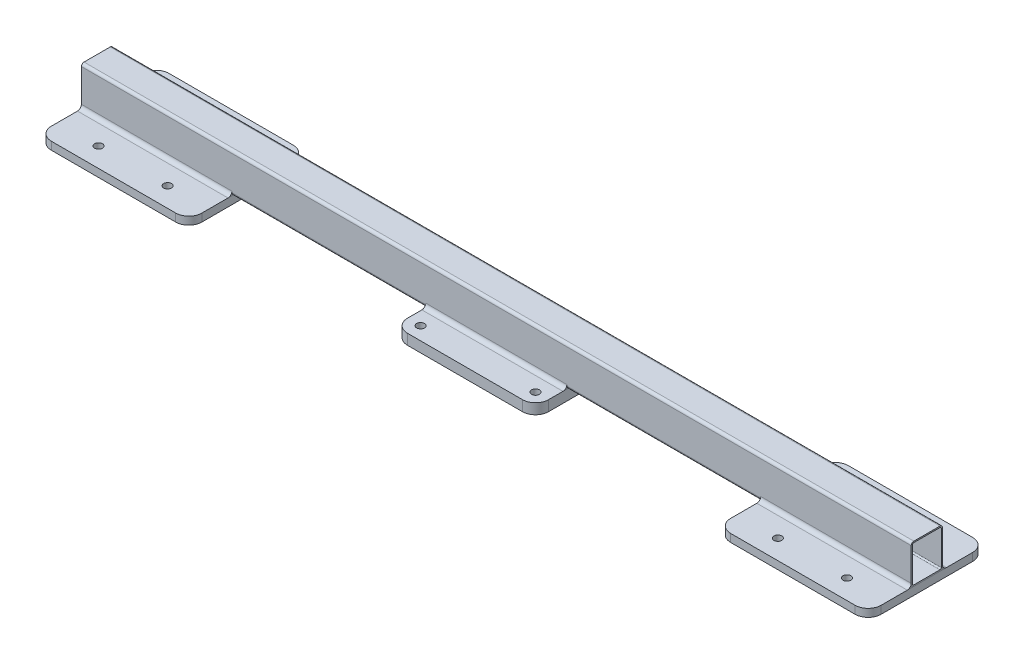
ISO-10303-21;
HEADER;
FILE_DESCRIPTION(('STEP AP214'),'2;1');
FILE_NAME('part.step','',(''),(''),'','','');
FILE_SCHEMA(('AUTOMOTIVE_DESIGN { 1 0 10303 214 1 1 1 1 }'));
ENDSEC;
DATA;
#1=APPLICATION_CONTEXT('core data for automotive mechanical design processes');
#2=APPLICATION_PROTOCOL_DEFINITION('international standard','automotive_design',2000,#1);
#3=PRODUCT_CONTEXT('',#1,'mechanical');
#4=PRODUCT('Part','Part','',(#3));
#5=PRODUCT_RELATED_PRODUCT_CATEGORY('part','',(#4));
#6=PRODUCT_DEFINITION_FORMATION('','',#4);
#7=PRODUCT_DEFINITION_CONTEXT('part definition',#1,'design');
#8=PRODUCT_DEFINITION('design','',#6,#7);
#9=PRODUCT_DEFINITION_SHAPE('','',#8);
#10=(LENGTH_UNIT() NAMED_UNIT(*) SI_UNIT(.MILLI.,.METRE.));
#11=(NAMED_UNIT(*) PLANE_ANGLE_UNIT() SI_UNIT($,.RADIAN.));
#12=(NAMED_UNIT(*) SI_UNIT($,.STERADIAN.) SOLID_ANGLE_UNIT());
#13=UNCERTAINTY_MEASURE_WITH_UNIT(LENGTH_MEASURE(1.E-05),#10,'distance_accuracy_value','');
#14=(GEOMETRIC_REPRESENTATION_CONTEXT(3) GLOBAL_UNCERTAINTY_ASSIGNED_CONTEXT((#13)) GLOBAL_UNIT_ASSIGNED_CONTEXT((#10,
#11,#12)) REPRESENTATION_CONTEXT('',''));
#15=CARTESIAN_POINT('',(0.,0.,0.));
#16=DIRECTION('',(0.,0.,1.));
#17=DIRECTION('',(1.,0.,0.));
#18=AXIS2_PLACEMENT_3D('',#15,#16,#17);
#19=CARTESIAN_POINT('',(149.577379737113,7.5,29.9999999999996));
#20=DIRECTION('',(0.,0.,1.));
#21=DIRECTION('',(0.,1.,0.));
#22=AXIS2_PLACEMENT_3D('',#19,#20,#21);
#23=PLANE('',#22);
#24=DIRECTION('',(-1.,0.,0.));
#25=VECTOR('',#24,1.);
#26=CARTESIAN_POINT('',(149.577379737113,5.,29.9999999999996));
#27=LINE('',#26,#25);
#28=CARTESIAN_POINT('',(135.,5.,29.9999999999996));
#29=VERTEX_POINT('',#28);
#30=CARTESIAN_POINT('',(-135.,5.,29.9999999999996));
#31=VERTEX_POINT('',#30);
#32=EDGE_CURVE('E112',#29,#31,#27,.T.);
#33=ORIENTED_EDGE('',*,*,#32,.T.);
#34=DIRECTION('',(0.,-1.,0.));
#35=VECTOR('',#34,1.);
#36=CARTESIAN_POINT('',(-135.,7.5,29.9999999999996));
#37=LINE('',#36,#35);
#38=CARTESIAN_POINT('',(-135.,7.5,29.9999999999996));
#39=VERTEX_POINT('',#38);
#40=EDGE_CURVE('E104',#39,#31,#37,.T.);
#41=ORIENTED_EDGE('',*,*,#40,.F.);
#42=DIRECTION('',(-1.,0.,0.));
#43=VECTOR('',#42,1.);
#44=CARTESIAN_POINT('',(149.577379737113,7.5,29.9999999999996));
#45=LINE('',#44,#43);
#46=CARTESIAN_POINT('',(135.,7.5,29.9999999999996));
#47=VERTEX_POINT('',#46);
#48=EDGE_CURVE('E99',#47,#39,#45,.T.);
#49=ORIENTED_EDGE('',*,*,#48,.F.);
#50=DIRECTION('',(0.,1.,0.));
#51=VECTOR('',#50,1.);
#52=CARTESIAN_POINT('',(135.,7.5,29.9999999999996));
#53=LINE('',#52,#51);
#54=EDGE_CURVE('E49',#29,#47,#53,.T.);
#55=ORIENTED_EDGE('',*,*,#54,.F.);
#56=EDGE_LOOP('',(#33,#41,#49,#55));
#57=FACE_BOUND('',#56,.T.);
#58=ADVANCED_FACE('F45',(#57),#23,.F.);
#59=CARTESIAN_POINT('',(149.577379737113,7.5,37.4999999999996));
#60=DIRECTION('',(-1.,0.,0.));
#61=DIRECTION('',(0.,0.,-1.));
#62=AXIS2_PLACEMENT_3D('',#59,#60,#61);
#63=CYLINDRICAL_SURFACE('',#62,7.5);
#64=ORIENTED_EDGE('',*,*,#48,.T.);
#65=CARTESIAN_POINT('',(-135.,7.5,37.4999999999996));
#66=DIRECTION('',(1.,0.,0.));
#67=DIRECTION('',(0.,0.,-1.));
#68=AXIS2_PLACEMENT_3D('',#65,#66,#67);
#69=CIRCLE('',#68,7.5);
#70=CARTESIAN_POINT('',(-135.,0.,37.4999999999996));
#71=VERTEX_POINT('',#70);
#72=EDGE_CURVE('E90',#71,#39,#69,.T.);
#73=ORIENTED_EDGE('',*,*,#72,.F.);
#74=DIRECTION('',(-1.,0.,0.));
#75=VECTOR('',#74,1.);
#76=CARTESIAN_POINT('',(149.577379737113,0.,37.4999999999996));
#77=LINE('',#76,#75);
#78=CARTESIAN_POINT('',(135.,0.,37.4999999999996));
#79=VERTEX_POINT('',#78);
#80=EDGE_CURVE('E95',#79,#71,#77,.T.);
#81=ORIENTED_EDGE('',*,*,#80,.F.);
#82=CARTESIAN_POINT('',(135.,7.5,37.4999999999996));
#83=DIRECTION('',(1.,0.,0.));
#84=DIRECTION('',(0.,0.,-1.));
#85=AXIS2_PLACEMENT_3D('',#82,#83,#84);
#86=CIRCLE('',#85,7.5);
#87=EDGE_CURVE('E109',#47,#79,#86,.F.);
#88=ORIENTED_EDGE('',*,*,#87,.F.);
#89=EDGE_LOOP('',(#64,#73,#81,#88));
#90=FACE_BOUND('',#89,.T.);
#91=ADVANCED_FACE('F101',(#90),#63,.F.);
#92=CARTESIAN_POINT('',(149.577379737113,0.,24.9999999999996));
#93=DIRECTION('',(0.,1.,0.));
#94=DIRECTION('',(0.,0.,-1.));
#95=AXIS2_PLACEMENT_3D('',#92,#93,#94);
#96=PLANE('',#95);
#97=ORIENTED_EDGE('',*,*,#80,.T.);
#98=DIRECTION('',(0.,0.,1.));
#99=VECTOR('',#98,1.);
#100=CARTESIAN_POINT('',(-135.,0.,24.9999999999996));
#101=LINE('',#100,#99);
#102=CARTESIAN_POINT('',(-135.,0.,24.9999999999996));
#103=VERTEX_POINT('',#102);
#104=EDGE_CURVE('E86',#103,#71,#101,.T.);
#105=ORIENTED_EDGE('',*,*,#104,.F.);
#106=DIRECTION('',(-1.,0.,0.));
#107=VECTOR('',#106,1.);
#108=CARTESIAN_POINT('',(149.577379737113,0.,24.9999999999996));
#109=LINE('',#108,#107);
#110=CARTESIAN_POINT('',(135.,0.,24.9999999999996));
#111=VERTEX_POINT('',#110);
#112=EDGE_CURVE('E98',#111,#103,#109,.T.);
#113=ORIENTED_EDGE('',*,*,#112,.F.);
#114=DIRECTION('',(0.,0.,-1.));
#115=VECTOR('',#114,1.);
#116=CARTESIAN_POINT('',(135.,0.,24.9999999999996));
#117=LINE('',#116,#115);
#118=EDGE_CURVE('E54',#79,#111,#117,.T.);
#119=ORIENTED_EDGE('',*,*,#118,.F.);
#120=EDGE_LOOP('',(#97,#105,#113,#119));
#121=FACE_BOUND('',#120,.T.);
#122=ADVANCED_FACE('F96',(#121),#96,.F.);
#123=CARTESIAN_POINT('',(149.577379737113,5.,24.9999999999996));
#124=DIRECTION('',(-1.,0.,0.));
#125=DIRECTION('',(0.,0.,-1.));
#126=AXIS2_PLACEMENT_3D('',#123,#124,#125);
#127=CYLINDRICAL_SURFACE('',#126,5.);
#128=ORIENTED_EDGE('',*,*,#112,.T.);
#129=CARTESIAN_POINT('',(-135.,5.,24.9999999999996));
#130=DIRECTION('',(1.,0.,0.));
#131=DIRECTION('',(0.,0.,-1.));
#132=AXIS2_PLACEMENT_3D('',#129,#130,#131);
#133=CIRCLE('',#132,5.);
#134=EDGE_CURVE('E92',#31,#103,#133,.T.);
#135=ORIENTED_EDGE('',*,*,#134,.F.);
#136=ORIENTED_EDGE('',*,*,#32,.F.);
#137=CARTESIAN_POINT('',(135.,5.,24.9999999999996));
#138=DIRECTION('',(1.,0.,0.));
#139=DIRECTION('',(0.,0.,-1.));
#140=AXIS2_PLACEMENT_3D('',#137,#138,#139);
#141=CIRCLE('',#140,5.);
#142=EDGE_CURVE('E12',#111,#29,#141,.F.);
#143=ORIENTED_EDGE('',*,*,#142,.F.);
#144=EDGE_LOOP('',(#128,#135,#136,#143));
#145=FACE_BOUND('',#144,.T.);
#146=ADVANCED_FACE('F47',(#145),#127,.F.);
#147=CARTESIAN_POINT('',(135.,-20.,90.));
#148=DIRECTION('',(-1.,0.,0.));
#149=DIRECTION('',(0.,0.,-1.));
#150=AXIS2_PLACEMENT_3D('',#147,#148,#149);
#151=PLANE('',#150);
#152=ORIENTED_EDGE('',*,*,#118,.T.);
#153=ORIENTED_EDGE('',*,*,#142,.T.);
#154=ORIENTED_EDGE('',*,*,#54,.T.);
#155=ORIENTED_EDGE('',*,*,#87,.T.);
#156=EDGE_LOOP('',(#152,#153,#154,#155));
#157=FACE_BOUND('',#156,.T.);
#158=ADVANCED_FACE('F118',(#157),#151,.F.);
#159=CARTESIAN_POINT('',(-135.,-20.,90.));
#160=DIRECTION('',(-1.,0.,0.));
#161=DIRECTION('',(0.,0.,-1.));
#162=AXIS2_PLACEMENT_3D('',#159,#160,#161);
#163=PLANE('',#162);
#164=ORIENTED_EDGE('',*,*,#134,.T.);
#165=ORIENTED_EDGE('',*,*,#104,.T.);
#166=ORIENTED_EDGE('',*,*,#72,.T.);
#167=ORIENTED_EDGE('',*,*,#40,.T.);
#168=EDGE_LOOP('',(#164,#165,#166,#167));
#169=FACE_BOUND('',#168,.T.);
#170=ADVANCED_FACE('F87',(#169),#163,.T.);
#171=CLOSED_SHELL('',(#58,#91,#122,#146,#158,#170));
#172=MANIFOLD_SOLID_BREP('B2',#171);
#173=CARTESIAN_POINT('',(149.577379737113,7.5,-29.9999999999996));
#174=DIRECTION('',(0.,0.,-1.));
#175=DIRECTION('',(0.,1.,0.));
#176=AXIS2_PLACEMENT_3D('',#173,#174,#175);
#177=PLANE('',#176);
#178=DIRECTION('',(-1.,0.,0.));
#179=VECTOR('',#178,1.);
#180=CARTESIAN_POINT('',(149.577379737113,5.,-29.9999999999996));
#181=LINE('',#180,#179);
#182=CARTESIAN_POINT('',(135.,5.,-29.9999999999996));
#183=VERTEX_POINT('',#182);
#184=CARTESIAN_POINT('',(-135.,5.,-29.9999999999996));
#185=VERTEX_POINT('',#184);
#186=EDGE_CURVE('E255',#183,#185,#181,.T.);
#187=ORIENTED_EDGE('',*,*,#186,.F.);
#188=DIRECTION('',(0.,1.,0.));
#189=VECTOR('',#188,1.);
#190=CARTESIAN_POINT('',(135.,7.5,-29.9999999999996));
#191=LINE('',#190,#189);
#192=CARTESIAN_POINT('',(135.,7.5,-29.9999999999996));
#193=VERTEX_POINT('',#192);
#194=EDGE_CURVE('E194',#183,#193,#191,.T.);
#195=ORIENTED_EDGE('',*,*,#194,.T.);
#196=DIRECTION('',(-1.,0.,0.));
#197=VECTOR('',#196,1.);
#198=CARTESIAN_POINT('',(149.577379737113,7.5,-29.9999999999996));
#199=LINE('',#198,#197);
#200=CARTESIAN_POINT('',(-135.,7.5,-29.9999999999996));
#201=VERTEX_POINT('',#200);
#202=EDGE_CURVE('E238',#193,#201,#199,.T.);
#203=ORIENTED_EDGE('',*,*,#202,.T.);
#204=DIRECTION('',(0.,-1.,0.));
#205=VECTOR('',#204,1.);
#206=CARTESIAN_POINT('',(-135.,7.5,-29.9999999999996));
#207=LINE('',#206,#205);
#208=EDGE_CURVE('E248',#201,#185,#207,.T.);
#209=ORIENTED_EDGE('',*,*,#208,.T.);
#210=EDGE_LOOP('',(#187,#195,#203,#209));
#211=FACE_BOUND('',#210,.T.);
#212=ADVANCED_FACE('F190',(#211),#177,.F.);
#213=CARTESIAN_POINT('',(149.577379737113,7.5,-37.4999999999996));
#214=DIRECTION('',(-1.,0.,0.));
#215=DIRECTION('',(0.,0.,1.));
#216=AXIS2_PLACEMENT_3D('',#213,#214,#215);
#217=CYLINDRICAL_SURFACE('',#216,7.5);
#218=ORIENTED_EDGE('',*,*,#202,.F.);
#219=CARTESIAN_POINT('',(135.,7.5,-37.4999999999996));
#220=DIRECTION('',(-1.,0.,0.));
#221=DIRECTION('',(0.,0.,1.));
#222=AXIS2_PLACEMENT_3D('',#219,#220,#221);
#223=CIRCLE('',#222,7.5);
#224=CARTESIAN_POINT('',(135.,0.,-37.4999999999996));
#225=VERTEX_POINT('',#224);
#226=EDGE_CURVE('E234',#193,#225,#223,.F.);
#227=ORIENTED_EDGE('',*,*,#226,.T.);
#228=DIRECTION('',(-1.,0.,0.));
#229=VECTOR('',#228,1.);
#230=CARTESIAN_POINT('',(149.577379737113,0.,-37.4999999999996));
#231=LINE('',#230,#229);
#232=CARTESIAN_POINT('',(-135.,0.,-37.4999999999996));
#233=VERTEX_POINT('',#232);
#234=EDGE_CURVE('E229',#225,#233,#231,.T.);
#235=ORIENTED_EDGE('',*,*,#234,.T.);
#236=CARTESIAN_POINT('',(-135.,7.5,-37.4999999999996));
#237=DIRECTION('',(-1.,0.,0.));
#238=DIRECTION('',(0.,0.,1.));
#239=AXIS2_PLACEMENT_3D('',#236,#237,#238);
#240=CIRCLE('',#239,7.5);
#241=EDGE_CURVE('E233',#233,#201,#240,.T.);
#242=ORIENTED_EDGE('',*,*,#241,.T.);
#243=EDGE_LOOP('',(#218,#227,#235,#242));
#244=FACE_BOUND('',#243,.T.);
#245=ADVANCED_FACE('F232',(#244),#217,.F.);
#246=CARTESIAN_POINT('',(149.577379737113,0.,-24.9999999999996));
#247=DIRECTION('',(0.,1.,0.));
#248=DIRECTION('',(0.,0.,1.));
#249=AXIS2_PLACEMENT_3D('',#246,#247,#248);
#250=PLANE('',#249);
#251=ORIENTED_EDGE('',*,*,#234,.F.);
#252=DIRECTION('',(0.,0.,1.));
#253=VECTOR('',#252,1.);
#254=CARTESIAN_POINT('',(135.,0.,-24.9999999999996));
#255=LINE('',#254,#253);
#256=CARTESIAN_POINT('',(135.,0.,-24.9999999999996));
#257=VERTEX_POINT('',#256);
#258=EDGE_CURVE('E199',#225,#257,#255,.T.);
#259=ORIENTED_EDGE('',*,*,#258,.T.);
#260=DIRECTION('',(-1.,0.,0.));
#261=VECTOR('',#260,1.);
#262=CARTESIAN_POINT('',(149.577379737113,0.,-24.9999999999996));
#263=LINE('',#262,#261);
#264=CARTESIAN_POINT('',(-135.,0.,-24.9999999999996));
#265=VERTEX_POINT('',#264);
#266=EDGE_CURVE('E237',#257,#265,#263,.T.);
#267=ORIENTED_EDGE('',*,*,#266,.T.);
#268=DIRECTION('',(0.,0.,-1.));
#269=VECTOR('',#268,1.);
#270=CARTESIAN_POINT('',(-135.,0.,-24.9999999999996));
#271=LINE('',#270,#269);
#272=EDGE_CURVE('E245',#265,#233,#271,.T.);
#273=ORIENTED_EDGE('',*,*,#272,.T.);
#274=EDGE_LOOP('',(#251,#259,#267,#273));
#275=FACE_BOUND('',#274,.T.);
#276=ADVANCED_FACE('F250',(#275),#250,.F.);
#277=CARTESIAN_POINT('',(149.577379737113,5.,-24.9999999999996));
#278=DIRECTION('',(-1.,0.,0.));
#279=DIRECTION('',(0.,0.,1.));
#280=AXIS2_PLACEMENT_3D('',#277,#278,#279);
#281=CYLINDRICAL_SURFACE('',#280,5.);
#282=ORIENTED_EDGE('',*,*,#266,.F.);
#283=CARTESIAN_POINT('',(135.,5.,-24.9999999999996));
#284=DIRECTION('',(-1.,0.,0.));
#285=DIRECTION('',(0.,0.,1.));
#286=AXIS2_PLACEMENT_3D('',#283,#284,#285);
#287=CIRCLE('',#286,5.);
#288=EDGE_CURVE('E43',#257,#183,#287,.F.);
#289=ORIENTED_EDGE('',*,*,#288,.T.);
#290=ORIENTED_EDGE('',*,*,#186,.T.);
#291=CARTESIAN_POINT('',(-135.,5.,-24.9999999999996));
#292=DIRECTION('',(-1.,0.,0.));
#293=DIRECTION('',(0.,0.,1.));
#294=AXIS2_PLACEMENT_3D('',#291,#292,#293);
#295=CIRCLE('',#294,5.);
#296=EDGE_CURVE('E253',#185,#265,#295,.T.);
#297=ORIENTED_EDGE('',*,*,#296,.T.);
#298=EDGE_LOOP('',(#282,#289,#290,#297));
#299=FACE_BOUND('',#298,.T.);
#300=ADVANCED_FACE('F192',(#299),#281,.F.);
#301=CARTESIAN_POINT('',(135.,-20.,-90.));
#302=DIRECTION('',(-1.,0.,0.));
#303=DIRECTION('',(0.,0.,1.));
#304=AXIS2_PLACEMENT_3D('',#301,#302,#303);
#305=PLANE('',#304);
#306=ORIENTED_EDGE('',*,*,#258,.F.);
#307=ORIENTED_EDGE('',*,*,#226,.F.);
#308=ORIENTED_EDGE('',*,*,#194,.F.);
#309=ORIENTED_EDGE('',*,*,#288,.F.);
#310=EDGE_LOOP('',(#306,#307,#308,#309));
#311=FACE_BOUND('',#310,.T.);
#312=ADVANCED_FACE('F263',(#311),#305,.F.);
#313=CARTESIAN_POINT('',(-135.,-20.,-90.));
#314=DIRECTION('',(-1.,0.,0.));
#315=DIRECTION('',(0.,0.,1.));
#316=AXIS2_PLACEMENT_3D('',#313,#314,#315);
#317=PLANE('',#316);
#318=ORIENTED_EDGE('',*,*,#296,.F.);
#319=ORIENTED_EDGE('',*,*,#208,.F.);
#320=ORIENTED_EDGE('',*,*,#241,.F.);
#321=ORIENTED_EDGE('',*,*,#272,.F.);
#322=EDGE_LOOP('',(#318,#319,#320,#321));
#323=FACE_BOUND('',#322,.T.);
#324=ADVANCED_FACE('F244',(#323),#317,.T.);
#325=CLOSED_SHELL('',(#212,#245,#276,#300,#312,#324));
#326=MANIFOLD_SOLID_BREP('B6',#325);
#327=CARTESIAN_POINT('',(-491.422620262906,5.,24.9999999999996));
#328=DIRECTION('',(-1.,0.,0.));
#329=DIRECTION('',(0.,0.,1.));
#330=AXIS2_PLACEMENT_3D('',#327,#328,#329);
#331=CYLINDRICAL_SURFACE('',#330,5.);
#332=CARTESIAN_POINT('',(-506.000000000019,5.,24.9999999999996));
#333=DIRECTION('',(-1.,0.,0.));
#334=DIRECTION('',(0.,0.,1.));
#335=AXIS2_PLACEMENT_3D('',#332,#333,#334);
#336=CIRCLE('',#335,5.);
#337=CARTESIAN_POINT('',(-506.000000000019,0.,24.9999999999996));
#338=VERTEX_POINT('',#337);
#339=CARTESIAN_POINT('',(-506.000000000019,5.,29.9999999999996));
#340=VERTEX_POINT('',#339);
#341=EDGE_CURVE('E331',#338,#340,#336,.T.);
#342=ORIENTED_EDGE('',*,*,#341,.F.);
#343=DIRECTION('',(-1.,0.,0.));
#344=VECTOR('',#343,1.);
#345=CARTESIAN_POINT('',(-491.422620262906,0.,24.9999999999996));
#346=LINE('',#345,#344);
#347=CARTESIAN_POINT('',(-793.999999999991,0.,24.9999999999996));
#348=VERTEX_POINT('',#347);
#349=EDGE_CURVE('E360',#338,#348,#346,.T.);
#350=ORIENTED_EDGE('',*,*,#349,.T.);
#351=CARTESIAN_POINT('',(-793.999999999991,5.,24.9999999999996));
#352=DIRECTION('',(1.,0.,0.));
#353=DIRECTION('',(0.,0.,1.));
#354=AXIS2_PLACEMENT_3D('',#351,#352,#353);
#355=CIRCLE('',#354,5.);
#356=CARTESIAN_POINT('',(-793.999999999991,5.,29.9999999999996));
#357=VERTEX_POINT('',#356);
#358=EDGE_CURVE('E367',#357,#348,#355,.T.);
#359=ORIENTED_EDGE('',*,*,#358,.F.);
#360=DIRECTION('',(-1.,0.,0.));
#361=VECTOR('',#360,1.);
#362=CARTESIAN_POINT('',(-491.422620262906,5.,29.9999999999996));
#363=LINE('',#362,#361);
#364=EDGE_CURVE('E383',#340,#357,#363,.T.);
#365=ORIENTED_EDGE('',*,*,#364,.F.);
#366=EDGE_LOOP('',(#342,#350,#359,#365));
#367=FACE_BOUND('',#366,.T.);
#368=ADVANCED_FACE('F323',(#367),#331,.F.);
#369=CARTESIAN_POINT('',(-491.422620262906,7.5,29.9999999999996));
#370=DIRECTION('',(0.,0.,-1.));
#371=DIRECTION('',(-1.,0.,0.));
#372=AXIS2_PLACEMENT_3D('',#369,#370,#371);
#373=PLANE('',#372);
#374=DIRECTION('',(0.,1.,0.));
#375=VECTOR('',#374,1.);
#376=CARTESIAN_POINT('',(-506.000000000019,7.5,29.9999999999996));
#377=LINE('',#376,#375);
#378=CARTESIAN_POINT('',(-506.000000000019,7.5,29.9999999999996));
#379=VERTEX_POINT('',#378);
#380=EDGE_CURVE('E388',#340,#379,#377,.T.);
#381=ORIENTED_EDGE('',*,*,#380,.F.);
#382=ORIENTED_EDGE('',*,*,#364,.T.);
#383=DIRECTION('',(0.,-1.,0.));
#384=VECTOR('',#383,1.);
#385=CARTESIAN_POINT('',(-793.999999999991,7.5,29.9999999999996));
#386=LINE('',#385,#384);
#387=CARTESIAN_POINT('',(-793.999999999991,7.5,29.9999999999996));
#388=VERTEX_POINT('',#387);
#389=EDGE_CURVE('E372',#388,#357,#386,.T.);
#390=ORIENTED_EDGE('',*,*,#389,.F.);
#391=DIRECTION('',(-1.,0.,0.));
#392=VECTOR('',#391,1.);
#393=CARTESIAN_POINT('',(-491.422620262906,7.5,29.9999999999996));
#394=LINE('',#393,#392);
#395=EDGE_CURVE('E377',#379,#388,#394,.T.);
#396=ORIENTED_EDGE('',*,*,#395,.F.);
#397=EDGE_LOOP('',(#381,#382,#390,#396));
#398=FACE_BOUND('',#397,.T.);
#399=ADVANCED_FACE('F397',(#398),#373,.T.);
#400=CARTESIAN_POINT('',(-491.422620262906,7.5,37.4999999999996));
#401=DIRECTION('',(-1.,0.,0.));
#402=DIRECTION('',(0.,0.,1.));
#403=AXIS2_PLACEMENT_3D('',#400,#401,#402);
#404=CYLINDRICAL_SURFACE('',#403,7.5);
#405=CARTESIAN_POINT('',(-506.000000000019,7.5,37.4999999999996));
#406=DIRECTION('',(-1.,0.,0.));
#407=DIRECTION('',(0.,0.,1.));
#408=AXIS2_PLACEMENT_3D('',#405,#406,#407);
#409=CIRCLE('',#408,7.5);
#410=CARTESIAN_POINT('',(-506.000000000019,0.,37.4999999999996));
#411=VERTEX_POINT('',#410);
#412=EDGE_CURVE('E384',#379,#411,#409,.T.);
#413=ORIENTED_EDGE('',*,*,#412,.F.);
#414=ORIENTED_EDGE('',*,*,#395,.T.);
#415=CARTESIAN_POINT('',(-793.999999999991,7.5,37.4999999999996));
#416=DIRECTION('',(1.,0.,0.));
#417=DIRECTION('',(0.,0.,1.));
#418=AXIS2_PLACEMENT_3D('',#415,#416,#417);
#419=CIRCLE('',#418,7.5);
#420=CARTESIAN_POINT('',(-793.999999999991,0.,37.4999999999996));
#421=VERTEX_POINT('',#420);
#422=EDGE_CURVE('E366',#421,#388,#419,.T.);
#423=ORIENTED_EDGE('',*,*,#422,.F.);
#424=DIRECTION('',(-1.,0.,0.));
#425=VECTOR('',#424,1.);
#426=CARTESIAN_POINT('',(-491.422620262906,0.,37.4999999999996));
#427=LINE('',#426,#425);
#428=EDGE_CURVE('E363',#411,#421,#427,.T.);
#429=ORIENTED_EDGE('',*,*,#428,.F.);
#430=EDGE_LOOP('',(#413,#414,#423,#429));
#431=FACE_BOUND('',#430,.T.);
#432=ADVANCED_FACE('F395',(#431),#404,.F.);
#433=CARTESIAN_POINT('',(-491.422620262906,0.,24.9999999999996));
#434=DIRECTION('',(0.,-1.,0.));
#435=DIRECTION('',(0.,0.,1.));
#436=AXIS2_PLACEMENT_3D('',#433,#434,#435);
#437=PLANE('',#436);
#438=DIRECTION('',(0.,0.,-1.));
#439=VECTOR('',#438,1.);
#440=CARTESIAN_POINT('',(-506.000000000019,0.,24.9999999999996));
#441=LINE('',#440,#439);
#442=EDGE_CURVE('E188',#411,#338,#441,.T.);
#443=ORIENTED_EDGE('',*,*,#442,.F.);
#444=ORIENTED_EDGE('',*,*,#428,.T.);
#445=DIRECTION('',(0.,0.,1.));
#446=VECTOR('',#445,1.);
#447=CARTESIAN_POINT('',(-793.999999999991,0.,24.9999999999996));
#448=LINE('',#447,#446);
#449=EDGE_CURVE('E356',#348,#421,#448,.T.);
#450=ORIENTED_EDGE('',*,*,#449,.F.);
#451=ORIENTED_EDGE('',*,*,#349,.F.);
#452=EDGE_LOOP('',(#443,#444,#450,#451));
#453=FACE_BOUND('',#452,.T.);
#454=ADVANCED_FACE('F358',(#453),#437,.T.);
#455=CARTESIAN_POINT('',(-793.999999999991,5.,24.9999999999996));
#456=DIRECTION('',(-1.,0.,0.));
#457=DIRECTION('',(0.,0.,1.));
#458=AXIS2_PLACEMENT_3D('',#455,#456,#457);
#459=PLANE('',#458);
#460=ORIENTED_EDGE('',*,*,#358,.T.);
#461=ORIENTED_EDGE('',*,*,#449,.T.);
#462=ORIENTED_EDGE('',*,*,#422,.T.);
#463=ORIENTED_EDGE('',*,*,#389,.T.);
#464=EDGE_LOOP('',(#460,#461,#462,#463));
#465=FACE_BOUND('',#464,.T.);
#466=ADVANCED_FACE('F370',(#465),#459,.T.);
#467=CARTESIAN_POINT('',(-506.000000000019,-15.,3.95115975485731E-13));
#468=DIRECTION('',(-1.,0.,0.));
#469=DIRECTION('',(0.,0.,1.));
#470=AXIS2_PLACEMENT_3D('',#467,#468,#469);
#471=PLANE('',#470);
#472=ORIENTED_EDGE('',*,*,#341,.T.);
#473=ORIENTED_EDGE('',*,*,#380,.T.);
#474=ORIENTED_EDGE('',*,*,#412,.T.);
#475=ORIENTED_EDGE('',*,*,#442,.T.);
#476=EDGE_LOOP('',(#472,#473,#474,#475));
#477=FACE_BOUND('',#476,.T.);
#478=ADVANCED_FACE('F391',(#477),#471,.F.);
#479=CLOSED_SHELL('',(#368,#399,#432,#454,#466,#478));
#480=MANIFOLD_SOLID_BREP('B37',#479);
#481=CARTESIAN_POINT('',(-491.422620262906,5.,-24.9999999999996));
#482=DIRECTION('',(-1.,0.,0.));
#483=DIRECTION('',(0.,0.,-1.));
#484=AXIS2_PLACEMENT_3D('',#481,#482,#483);
#485=CYLINDRICAL_SURFACE('',#484,5.);
#486=CARTESIAN_POINT('',(-506.000000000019,5.,-24.9999999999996));
#487=DIRECTION('',(1.,0.,0.));
#488=DIRECTION('',(0.,0.,-1.));
#489=AXIS2_PLACEMENT_3D('',#486,#487,#488);
#490=CIRCLE('',#489,5.);
#491=CARTESIAN_POINT('',(-506.000000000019,0.,-24.9999999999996));
#492=VERTEX_POINT('',#491);
#493=CARTESIAN_POINT('',(-506.000000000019,5.,-29.9999999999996));
#494=VERTEX_POINT('',#493);
#495=EDGE_CURVE('E476',#492,#494,#490,.T.);
#496=ORIENTED_EDGE('',*,*,#495,.T.);
#497=DIRECTION('',(-1.,0.,0.));
#498=VECTOR('',#497,1.);
#499=CARTESIAN_POINT('',(-491.422620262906,5.,-29.9999999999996));
#500=LINE('',#499,#498);
#501=CARTESIAN_POINT('',(-793.999999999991,5.,-29.9999999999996));
#502=VERTEX_POINT('',#501);
#503=EDGE_CURVE('E519',#494,#502,#500,.T.);
#504=ORIENTED_EDGE('',*,*,#503,.T.);
#505=CARTESIAN_POINT('',(-793.999999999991,5.,-24.9999999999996));
#506=DIRECTION('',(-1.,0.,0.));
#507=DIRECTION('',(0.,0.,-1.));
#508=AXIS2_PLACEMENT_3D('',#505,#506,#507);
#509=CIRCLE('',#508,5.);
#510=CARTESIAN_POINT('',(-793.999999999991,0.,-24.9999999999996));
#511=VERTEX_POINT('',#510);
#512=EDGE_CURVE('E506',#502,#511,#509,.T.);
#513=ORIENTED_EDGE('',*,*,#512,.T.);
#514=DIRECTION('',(-1.,0.,0.));
#515=VECTOR('',#514,1.);
#516=CARTESIAN_POINT('',(-491.422620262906,0.,-24.9999999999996));
#517=LINE('',#516,#515);
#518=EDGE_CURVE('E511',#492,#511,#517,.T.);
#519=ORIENTED_EDGE('',*,*,#518,.F.);
#520=EDGE_LOOP('',(#496,#504,#513,#519));
#521=FACE_BOUND('',#520,.T.);
#522=ADVANCED_FACE('F468',(#521),#485,.F.);
#523=CARTESIAN_POINT('',(-491.422620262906,7.5,-29.9999999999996));
#524=DIRECTION('',(0.,0.,1.));
#525=DIRECTION('',(-1.,0.,0.));
#526=AXIS2_PLACEMENT_3D('',#523,#524,#525);
#527=PLANE('',#526);
#528=DIRECTION('',(0.,1.,0.));
#529=VECTOR('',#528,1.);
#530=CARTESIAN_POINT('',(-506.000000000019,7.5,-29.9999999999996));
#531=LINE('',#530,#529);
#532=CARTESIAN_POINT('',(-506.000000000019,7.5,-29.9999999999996));
#533=VERTEX_POINT('',#532);
#534=EDGE_CURVE('E538',#494,#533,#531,.T.);
#535=ORIENTED_EDGE('',*,*,#534,.T.);
#536=DIRECTION('',(-1.,0.,0.));
#537=VECTOR('',#536,1.);
#538=CARTESIAN_POINT('',(-491.422620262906,7.5,-29.9999999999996));
#539=LINE('',#538,#537);
#540=CARTESIAN_POINT('',(-793.999999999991,7.5,-29.9999999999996));
#541=VERTEX_POINT('',#540);
#542=EDGE_CURVE('E528',#533,#541,#539,.T.);
#543=ORIENTED_EDGE('',*,*,#542,.T.);
#544=DIRECTION('',(0.,-1.,0.));
#545=VECTOR('',#544,1.);
#546=CARTESIAN_POINT('',(-793.999999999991,7.5,-29.9999999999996));
#547=LINE('',#546,#545);
#548=EDGE_CURVE('E517',#541,#502,#547,.T.);
#549=ORIENTED_EDGE('',*,*,#548,.T.);
#550=ORIENTED_EDGE('',*,*,#503,.F.);
#551=EDGE_LOOP('',(#535,#543,#549,#550));
#552=FACE_BOUND('',#551,.T.);
#553=ADVANCED_FACE('F542',(#552),#527,.T.);
#554=CARTESIAN_POINT('',(-491.422620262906,7.5,-37.4999999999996));
#555=DIRECTION('',(-1.,0.,0.));
#556=DIRECTION('',(0.,0.,-1.));
#557=AXIS2_PLACEMENT_3D('',#554,#555,#556);
#558=CYLINDRICAL_SURFACE('',#557,7.5);
#559=CARTESIAN_POINT('',(-506.000000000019,7.5,-37.4999999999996));
#560=DIRECTION('',(1.,0.,0.));
#561=DIRECTION('',(0.,0.,-1.));
#562=AXIS2_PLACEMENT_3D('',#559,#560,#561);
#563=CIRCLE('',#562,7.5);
#564=CARTESIAN_POINT('',(-506.000000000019,0.,-37.4999999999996));
#565=VERTEX_POINT('',#564);
#566=EDGE_CURVE('E527',#533,#565,#563,.T.);
#567=ORIENTED_EDGE('',*,*,#566,.T.);
#568=DIRECTION('',(-1.,0.,0.));
#569=VECTOR('',#568,1.);
#570=CARTESIAN_POINT('',(-491.422620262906,0.,-37.4999999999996));
#571=LINE('',#570,#569);
#572=CARTESIAN_POINT('',(-793.999999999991,0.,-37.4999999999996));
#573=VERTEX_POINT('',#572);
#574=EDGE_CURVE('E516',#565,#573,#571,.T.);
#575=ORIENTED_EDGE('',*,*,#574,.T.);
#576=CARTESIAN_POINT('',(-793.999999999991,7.5,-37.4999999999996));
#577=DIRECTION('',(-1.,0.,0.));
#578=DIRECTION('',(0.,0.,-1.));
#579=AXIS2_PLACEMENT_3D('',#576,#577,#578);
#580=CIRCLE('',#579,7.5);
#581=EDGE_CURVE('E508',#573,#541,#580,.T.);
#582=ORIENTED_EDGE('',*,*,#581,.T.);
#583=ORIENTED_EDGE('',*,*,#542,.F.);
#584=EDGE_LOOP('',(#567,#575,#582,#583));
#585=FACE_BOUND('',#584,.T.);
#586=ADVANCED_FACE('F533',(#585),#558,.F.);
#587=CARTESIAN_POINT('',(-491.422620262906,0.,-24.9999999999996));
#588=DIRECTION('',(0.,-1.,0.));
#589=DIRECTION('',(0.,0.,-1.));
#590=AXIS2_PLACEMENT_3D('',#587,#588,#589);
#591=PLANE('',#590);
#592=DIRECTION('',(0.,0.,1.));
#593=VECTOR('',#592,1.);
#594=CARTESIAN_POINT('',(-506.000000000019,0.,-24.9999999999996));
#595=LINE('',#594,#593);
#596=EDGE_CURVE('E321',#565,#492,#595,.T.);
#597=ORIENTED_EDGE('',*,*,#596,.T.);
#598=ORIENTED_EDGE('',*,*,#518,.T.);
#599=DIRECTION('',(0.,0.,-1.));
#600=VECTOR('',#599,1.);
#601=CARTESIAN_POINT('',(-793.999999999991,0.,-24.9999999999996));
#602=LINE('',#601,#600);
#603=EDGE_CURVE('E502',#511,#573,#602,.T.);
#604=ORIENTED_EDGE('',*,*,#603,.T.);
#605=ORIENTED_EDGE('',*,*,#574,.F.);
#606=EDGE_LOOP('',(#597,#598,#604,#605));
#607=FACE_BOUND('',#606,.T.);
#608=ADVANCED_FACE('F512',(#607),#591,.T.);
#609=CARTESIAN_POINT('',(-793.999999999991,5.,-24.9999999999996));
#610=DIRECTION('',(-1.,0.,0.));
#611=DIRECTION('',(0.,0.,-1.));
#612=AXIS2_PLACEMENT_3D('',#609,#610,#611);
#613=PLANE('',#612);
#614=ORIENTED_EDGE('',*,*,#512,.F.);
#615=ORIENTED_EDGE('',*,*,#548,.F.);
#616=ORIENTED_EDGE('',*,*,#581,.F.);
#617=ORIENTED_EDGE('',*,*,#603,.F.);
#618=EDGE_LOOP('',(#614,#615,#616,#617));
#619=FACE_BOUND('',#618,.T.);
#620=ADVANCED_FACE('F503',(#619),#613,.T.);
#621=CARTESIAN_POINT('',(-506.000000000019,-15.,-3.95115975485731E-13));
#622=DIRECTION('',(-1.,0.,0.));
#623=DIRECTION('',(0.,0.,-1.));
#624=AXIS2_PLACEMENT_3D('',#621,#622,#623);
#625=PLANE('',#624);
#626=ORIENTED_EDGE('',*,*,#495,.F.);
#627=ORIENTED_EDGE('',*,*,#596,.F.);
#628=ORIENTED_EDGE('',*,*,#566,.F.);
#629=ORIENTED_EDGE('',*,*,#534,.F.);
#630=EDGE_LOOP('',(#626,#627,#628,#629));
#631=FACE_BOUND('',#630,.T.);
#632=ADVANCED_FACE('F541',(#631),#625,.F.);
#633=CLOSED_SHELL('',(#522,#553,#586,#608,#620,#632));
#634=MANIFOLD_SOLID_BREP('B182',#633);
#635=CARTESIAN_POINT('',(491.422620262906,5.,24.9999999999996));
#636=DIRECTION('',(1.,0.,0.));
#637=DIRECTION('',(0.,0.,1.));
#638=AXIS2_PLACEMENT_3D('',#635,#636,#637);
#639=CYLINDRICAL_SURFACE('',#638,5.);
#640=CARTESIAN_POINT('',(506.000000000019,5.,24.9999999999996));
#641=DIRECTION('',(-1.,0.,0.));
#642=DIRECTION('',(0.,0.,1.));
#643=AXIS2_PLACEMENT_3D('',#640,#641,#642);
#644=CIRCLE('',#643,5.);
#645=CARTESIAN_POINT('',(506.000000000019,0.,24.9999999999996));
#646=VERTEX_POINT('',#645);
#647=CARTESIAN_POINT('',(506.000000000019,5.,29.9999999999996));
#648=VERTEX_POINT('',#647);
#649=EDGE_CURVE('E621',#646,#648,#644,.T.);
#650=ORIENTED_EDGE('',*,*,#649,.T.);
#651=DIRECTION('',(1.,0.,0.));
#652=VECTOR('',#651,1.);
#653=CARTESIAN_POINT('',(491.422620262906,5.,29.9999999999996));
#654=LINE('',#653,#652);
#655=CARTESIAN_POINT('',(793.999999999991,5.,29.9999999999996));
#656=VERTEX_POINT('',#655);
#657=EDGE_CURVE('E664',#648,#656,#654,.T.);
#658=ORIENTED_EDGE('',*,*,#657,.T.);
#659=CARTESIAN_POINT('',(793.999999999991,5.,24.9999999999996));
#660=DIRECTION('',(1.,0.,0.));
#661=DIRECTION('',(0.,0.,1.));
#662=AXIS2_PLACEMENT_3D('',#659,#660,#661);
#663=CIRCLE('',#662,5.);
#664=CARTESIAN_POINT('',(793.999999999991,0.,24.9999999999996));
#665=VERTEX_POINT('',#664);
#666=EDGE_CURVE('E651',#656,#665,#663,.T.);
#667=ORIENTED_EDGE('',*,*,#666,.T.);
#668=DIRECTION('',(1.,0.,0.));
#669=VECTOR('',#668,1.);
#670=CARTESIAN_POINT('',(491.422620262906,0.,24.9999999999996));
#671=LINE('',#670,#669);
#672=EDGE_CURVE('E656',#646,#665,#671,.T.);
#673=ORIENTED_EDGE('',*,*,#672,.F.);
#674=EDGE_LOOP('',(#650,#658,#667,#673));
#675=FACE_BOUND('',#674,.T.);
#676=ADVANCED_FACE('F613',(#675),#639,.F.);
#677=CARTESIAN_POINT('',(491.422620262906,7.5,29.9999999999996));
#678=DIRECTION('',(0.,0.,-1.));
#679=DIRECTION('',(1.,0.,0.));
#680=AXIS2_PLACEMENT_3D('',#677,#678,#679);
#681=PLANE('',#680);
#682=DIRECTION('',(0.,1.,0.));
#683=VECTOR('',#682,1.);
#684=CARTESIAN_POINT('',(506.000000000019,7.5,29.9999999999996));
#685=LINE('',#684,#683);
#686=CARTESIAN_POINT('',(506.000000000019,7.5,29.9999999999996));
#687=VERTEX_POINT('',#686);
#688=EDGE_CURVE('E683',#648,#687,#685,.T.);
#689=ORIENTED_EDGE('',*,*,#688,.T.);
#690=DIRECTION('',(1.,0.,0.));
#691=VECTOR('',#690,1.);
#692=CARTESIAN_POINT('',(491.422620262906,7.5,29.9999999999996));
#693=LINE('',#692,#691);
#694=CARTESIAN_POINT('',(793.999999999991,7.5,29.9999999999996));
#695=VERTEX_POINT('',#694);
#696=EDGE_CURVE('E673',#687,#695,#693,.T.);
#697=ORIENTED_EDGE('',*,*,#696,.T.);
#698=DIRECTION('',(0.,-1.,0.));
#699=VECTOR('',#698,1.);
#700=CARTESIAN_POINT('',(793.999999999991,7.5,29.9999999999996));
#701=LINE('',#700,#699);
#702=EDGE_CURVE('E662',#695,#656,#701,.T.);
#703=ORIENTED_EDGE('',*,*,#702,.T.);
#704=ORIENTED_EDGE('',*,*,#657,.F.);
#705=EDGE_LOOP('',(#689,#697,#703,#704));
#706=FACE_BOUND('',#705,.T.);
#707=ADVANCED_FACE('F687',(#706),#681,.T.);
#708=CARTESIAN_POINT('',(491.422620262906,7.5,37.4999999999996));
#709=DIRECTION('',(1.,0.,0.));
#710=DIRECTION('',(0.,0.,1.));
#711=AXIS2_PLACEMENT_3D('',#708,#709,#710);
#712=CYLINDRICAL_SURFACE('',#711,7.5);
#713=CARTESIAN_POINT('',(506.000000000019,7.5,37.4999999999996));
#714=DIRECTION('',(-1.,0.,0.));
#715=DIRECTION('',(0.,0.,1.));
#716=AXIS2_PLACEMENT_3D('',#713,#714,#715);
#717=CIRCLE('',#716,7.5);
#718=CARTESIAN_POINT('',(506.000000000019,0.,37.4999999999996));
#719=VERTEX_POINT('',#718);
#720=EDGE_CURVE('E672',#687,#719,#717,.T.);
#721=ORIENTED_EDGE('',*,*,#720,.T.);
#722=DIRECTION('',(1.,0.,0.));
#723=VECTOR('',#722,1.);
#724=CARTESIAN_POINT('',(491.422620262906,0.,37.4999999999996));
#725=LINE('',#724,#723);
#726=CARTESIAN_POINT('',(793.999999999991,0.,37.4999999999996));
#727=VERTEX_POINT('',#726);
#728=EDGE_CURVE('E661',#719,#727,#725,.T.);
#729=ORIENTED_EDGE('',*,*,#728,.T.);
#730=CARTESIAN_POINT('',(793.999999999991,7.5,37.4999999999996));
#731=DIRECTION('',(1.,0.,0.));
#732=DIRECTION('',(0.,0.,1.));
#733=AXIS2_PLACEMENT_3D('',#730,#731,#732);
#734=CIRCLE('',#733,7.5);
#735=EDGE_CURVE('E653',#727,#695,#734,.T.);
#736=ORIENTED_EDGE('',*,*,#735,.T.);
#737=ORIENTED_EDGE('',*,*,#696,.F.);
#738=EDGE_LOOP('',(#721,#729,#736,#737));
#739=FACE_BOUND('',#738,.T.);
#740=ADVANCED_FACE('F678',(#739),#712,.F.);
#741=CARTESIAN_POINT('',(491.422620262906,0.,24.9999999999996));
#742=DIRECTION('',(0.,-1.,0.));
#743=DIRECTION('',(0.,0.,1.));
#744=AXIS2_PLACEMENT_3D('',#741,#742,#743);
#745=PLANE('',#744);
#746=DIRECTION('',(0.,0.,-1.));
#747=VECTOR('',#746,1.);
#748=CARTESIAN_POINT('',(506.000000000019,0.,24.9999999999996));
#749=LINE('',#748,#747);
#750=EDGE_CURVE('E466',#719,#646,#749,.T.);
#751=ORIENTED_EDGE('',*,*,#750,.T.);
#752=ORIENTED_EDGE('',*,*,#672,.T.);
#753=DIRECTION('',(0.,0.,1.));
#754=VECTOR('',#753,1.);
#755=CARTESIAN_POINT('',(793.999999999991,0.,24.9999999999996));
#756=LINE('',#755,#754);
#757=EDGE_CURVE('E647',#665,#727,#756,.T.);
#758=ORIENTED_EDGE('',*,*,#757,.T.);
#759=ORIENTED_EDGE('',*,*,#728,.F.);
#760=EDGE_LOOP('',(#751,#752,#758,#759));
#761=FACE_BOUND('',#760,.T.);
#762=ADVANCED_FACE('F657',(#761),#745,.T.);
#763=CARTESIAN_POINT('',(793.999999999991,5.,24.9999999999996));
#764=DIRECTION('',(1.,0.,0.));
#765=DIRECTION('',(0.,0.,1.));
#766=AXIS2_PLACEMENT_3D('',#763,#764,#765);
#767=PLANE('',#766);
#768=ORIENTED_EDGE('',*,*,#666,.F.);
#769=ORIENTED_EDGE('',*,*,#702,.F.);
#770=ORIENTED_EDGE('',*,*,#735,.F.);
#771=ORIENTED_EDGE('',*,*,#757,.F.);
#772=EDGE_LOOP('',(#768,#769,#770,#771));
#773=FACE_BOUND('',#772,.T.);
#774=ADVANCED_FACE('F648',(#773),#767,.T.);
#775=CARTESIAN_POINT('',(506.000000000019,-15.,3.95115975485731E-13));
#776=DIRECTION('',(1.,0.,0.));
#777=DIRECTION('',(0.,0.,1.));
#778=AXIS2_PLACEMENT_3D('',#775,#776,#777);
#779=PLANE('',#778);
#780=ORIENTED_EDGE('',*,*,#649,.F.);
#781=ORIENTED_EDGE('',*,*,#750,.F.);
#782=ORIENTED_EDGE('',*,*,#720,.F.);
#783=ORIENTED_EDGE('',*,*,#688,.F.);
#784=EDGE_LOOP('',(#780,#781,#782,#783));
#785=FACE_BOUND('',#784,.T.);
#786=ADVANCED_FACE('F686',(#785),#779,.F.);
#787=CLOSED_SHELL('',(#676,#707,#740,#762,#774,#786));
#788=MANIFOLD_SOLID_BREP('B315',#787);
#789=CARTESIAN_POINT('',(491.422620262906,5.,-24.9999999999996));
#790=DIRECTION('',(1.,0.,0.));
#791=DIRECTION('',(0.,0.,-1.));
#792=AXIS2_PLACEMENT_3D('',#789,#790,#791);
#793=CYLINDRICAL_SURFACE('',#792,5.);
#794=CARTESIAN_POINT('',(506.000000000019,5.,-24.9999999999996));
#795=DIRECTION('',(1.,0.,0.));
#796=DIRECTION('',(0.,0.,-1.));
#797=AXIS2_PLACEMENT_3D('',#794,#795,#796);
#798=CIRCLE('',#797,5.);
#799=CARTESIAN_POINT('',(506.000000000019,0.,-24.9999999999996));
#800=VERTEX_POINT('',#799);
#801=CARTESIAN_POINT('',(506.000000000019,5.,-29.9999999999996));
#802=VERTEX_POINT('',#801);
#803=EDGE_CURVE('E766',#800,#802,#798,.T.);
#804=ORIENTED_EDGE('',*,*,#803,.F.);
#805=DIRECTION('',(1.,0.,0.));
#806=VECTOR('',#805,1.);
#807=CARTESIAN_POINT('',(491.422620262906,0.,-24.9999999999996));
#808=LINE('',#807,#806);
#809=CARTESIAN_POINT('',(793.999999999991,0.,-24.9999999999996));
#810=VERTEX_POINT('',#809);
#811=EDGE_CURVE('E792',#800,#810,#808,.T.);
#812=ORIENTED_EDGE('',*,*,#811,.T.);
#813=CARTESIAN_POINT('',(793.999999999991,5.,-24.9999999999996));
#814=DIRECTION('',(-1.,0.,0.));
#815=DIRECTION('',(0.,0.,-1.));
#816=AXIS2_PLACEMENT_3D('',#813,#814,#815);
#817=CIRCLE('',#816,5.);
#818=CARTESIAN_POINT('',(793.999999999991,5.,-29.9999999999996));
#819=VERTEX_POINT('',#818);
#820=EDGE_CURVE('E796',#819,#810,#817,.T.);
#821=ORIENTED_EDGE('',*,*,#820,.F.);
#822=DIRECTION('',(1.,0.,0.));
#823=VECTOR('',#822,1.);
#824=CARTESIAN_POINT('',(491.422620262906,5.,-29.9999999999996));
#825=LINE('',#824,#823);
#826=EDGE_CURVE('E818',#802,#819,#825,.T.);
#827=ORIENTED_EDGE('',*,*,#826,.F.);
#828=EDGE_LOOP('',(#804,#812,#821,#827));
#829=FACE_BOUND('',#828,.T.);
#830=ADVANCED_FACE('F758',(#829),#793,.F.);
#831=CARTESIAN_POINT('',(491.422620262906,7.5,-29.9999999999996));
#832=DIRECTION('',(0.,0.,1.));
#833=DIRECTION('',(1.,0.,0.));
#834=AXIS2_PLACEMENT_3D('',#831,#832,#833);
#835=PLANE('',#834);
#836=DIRECTION('',(0.,1.,0.));
#837=VECTOR('',#836,1.);
#838=CARTESIAN_POINT('',(506.000000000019,7.5,-29.9999999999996));
#839=LINE('',#838,#837);
#840=CARTESIAN_POINT('',(506.000000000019,7.5,-29.9999999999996));
#841=VERTEX_POINT('',#840);
#842=EDGE_CURVE('E830',#802,#841,#839,.T.);
#843=ORIENTED_EDGE('',*,*,#842,.F.);
#844=ORIENTED_EDGE('',*,*,#826,.T.);
#845=DIRECTION('',(0.,-1.,0.));
#846=VECTOR('',#845,1.);
#847=CARTESIAN_POINT('',(793.999999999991,7.5,-29.9999999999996));
#848=LINE('',#847,#846);
#849=CARTESIAN_POINT('',(793.999999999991,7.5,-29.9999999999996));
#850=VERTEX_POINT('',#849);
#851=EDGE_CURVE('E800',#850,#819,#848,.T.);
#852=ORIENTED_EDGE('',*,*,#851,.F.);
#853=DIRECTION('',(1.,0.,0.));
#854=VECTOR('',#853,1.);
#855=CARTESIAN_POINT('',(491.422620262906,7.5,-29.9999999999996));
#856=LINE('',#855,#854);
#857=EDGE_CURVE('E821',#841,#850,#856,.T.);
#858=ORIENTED_EDGE('',*,*,#857,.F.);
#859=EDGE_LOOP('',(#843,#844,#852,#858));
#860=FACE_BOUND('',#859,.T.);
#861=ADVANCED_FACE('F829',(#860),#835,.T.);
#862=CARTESIAN_POINT('',(491.422620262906,7.5,-37.4999999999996));
#863=DIRECTION('',(1.,0.,0.));
#864=DIRECTION('',(0.,0.,-1.));
#865=AXIS2_PLACEMENT_3D('',#862,#863,#864);
#866=CYLINDRICAL_SURFACE('',#865,7.5);
#867=CARTESIAN_POINT('',(506.000000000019,7.5,-37.4999999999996));
#868=DIRECTION('',(1.,0.,0.));
#869=DIRECTION('',(0.,0.,-1.));
#870=AXIS2_PLACEMENT_3D('',#867,#868,#869);
#871=CIRCLE('',#870,7.5);
#872=CARTESIAN_POINT('',(506.000000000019,0.,-37.4999999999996));
#873=VERTEX_POINT('',#872);
#874=EDGE_CURVE('E820',#841,#873,#871,.T.);
#875=ORIENTED_EDGE('',*,*,#874,.F.);
#876=ORIENTED_EDGE('',*,*,#857,.T.);
#877=CARTESIAN_POINT('',(793.999999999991,7.5,-37.4999999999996));
#878=DIRECTION('',(-1.,0.,0.));
#879=DIRECTION('',(0.,0.,-1.));
#880=AXIS2_PLACEMENT_3D('',#877,#878,#879);
#881=CIRCLE('',#880,7.5);
#882=CARTESIAN_POINT('',(793.999999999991,0.,-37.4999999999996));
#883=VERTEX_POINT('',#882);
#884=EDGE_CURVE('E808',#883,#850,#881,.T.);
#885=ORIENTED_EDGE('',*,*,#884,.F.);
#886=DIRECTION('',(1.,0.,0.));
#887=VECTOR('',#886,1.);
#888=CARTESIAN_POINT('',(491.422620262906,0.,-37.4999999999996));
#889=LINE('',#888,#887);
#890=EDGE_CURVE('E799',#873,#883,#889,.T.);
#891=ORIENTED_EDGE('',*,*,#890,.F.);
#892=EDGE_LOOP('',(#875,#876,#885,#891));
#893=FACE_BOUND('',#892,.T.);
#894=ADVANCED_FACE('F826',(#893),#866,.F.);
#895=CARTESIAN_POINT('',(491.422620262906,0.,-24.9999999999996));
#896=DIRECTION('',(0.,-1.,0.));
#897=DIRECTION('',(0.,0.,-1.));
#898=AXIS2_PLACEMENT_3D('',#895,#896,#897);
#899=PLANE('',#898);
#900=DIRECTION('',(0.,0.,1.));
#901=VECTOR('',#900,1.);
#902=CARTESIAN_POINT('',(506.000000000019,0.,-24.9999999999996));
#903=LINE('',#902,#901);
#904=EDGE_CURVE('E611',#873,#800,#903,.T.);
#905=ORIENTED_EDGE('',*,*,#904,.F.);
#906=ORIENTED_EDGE('',*,*,#890,.T.);
#907=DIRECTION('',(0.,0.,-1.));
#908=VECTOR('',#907,1.);
#909=CARTESIAN_POINT('',(793.999999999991,0.,-24.9999999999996));
#910=LINE('',#909,#908);
#911=EDGE_CURVE('E802',#810,#883,#910,.T.);
#912=ORIENTED_EDGE('',*,*,#911,.F.);
#913=ORIENTED_EDGE('',*,*,#811,.F.);
#914=EDGE_LOOP('',(#905,#906,#912,#913));
#915=FACE_BOUND('',#914,.T.);
#916=ADVANCED_FACE('F803',(#915),#899,.T.);
#917=CARTESIAN_POINT('',(793.999999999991,5.,-24.9999999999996));
#918=DIRECTION('',(1.,0.,0.));
#919=DIRECTION('',(0.,0.,-1.));
#920=AXIS2_PLACEMENT_3D('',#917,#918,#919);
#921=PLANE('',#920);
#922=ORIENTED_EDGE('',*,*,#820,.T.);
#923=ORIENTED_EDGE('',*,*,#911,.T.);
#924=ORIENTED_EDGE('',*,*,#884,.T.);
#925=ORIENTED_EDGE('',*,*,#851,.T.);
#926=EDGE_LOOP('',(#922,#923,#924,#925));
#927=FACE_BOUND('',#926,.T.);
#928=ADVANCED_FACE('F810',(#927),#921,.T.);
#929=CARTESIAN_POINT('',(506.000000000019,-15.,-3.95115975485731E-13));
#930=DIRECTION('',(1.,0.,0.));
#931=DIRECTION('',(0.,0.,-1.));
#932=AXIS2_PLACEMENT_3D('',#929,#930,#931);
#933=PLANE('',#932);
#934=ORIENTED_EDGE('',*,*,#803,.T.);
#935=ORIENTED_EDGE('',*,*,#842,.T.);
#936=ORIENTED_EDGE('',*,*,#874,.T.);
#937=ORIENTED_EDGE('',*,*,#904,.T.);
#938=EDGE_LOOP('',(#934,#935,#936,#937));
#939=FACE_BOUND('',#938,.T.);
#940=ADVANCED_FACE('F831',(#939),#933,.F.);
#941=CLOSED_SHELL('',(#830,#861,#894,#916,#928,#940));
#942=MANIFOLD_SOLID_BREP('B460',#941);
#943=CARTESIAN_POINT('',(-135.,-20.,-90.));
#944=DIRECTION('',(-1.,0.,0.));
#945=DIRECTION('',(0.,0.,1.));
#946=AXIS2_PLACEMENT_3D('',#943,#944,#945);
#947=PLANE('',#946);
#948=DIRECTION('',(0.,0.,1.));
#949=VECTOR('',#948,1.);
#950=CARTESIAN_POINT('',(-135.,-20.,-90.));
#951=LINE('',#950,#949);
#952=CARTESIAN_POINT('',(-135.,-20.,-65.));
#953=VERTEX_POINT('',#952);
#954=CARTESIAN_POINT('',(-135.,-20.,64.9999999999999));
#955=VERTEX_POINT('',#954);
#956=EDGE_CURVE('E1021',#953,#955,#951,.T.);
#957=ORIENTED_EDGE('',*,*,#956,.T.);
#958=DIRECTION('',(0.,1.,0.));
#959=VECTOR('',#958,1.);
#960=CARTESIAN_POINT('',(-135.,-20.,65.));
#961=LINE('',#960,#959);
#962=CARTESIAN_POINT('',(-135.,0.,64.9999999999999));
#963=VERTEX_POINT('',#962);
#964=EDGE_CURVE('E976',#955,#963,#961,.T.);
#965=ORIENTED_EDGE('',*,*,#964,.T.);
#966=DIRECTION('',(0.,0.,1.));
#967=VECTOR('',#966,1.);
#968=CARTESIAN_POINT('',(-135.,0.,-90.));
#969=LINE('',#968,#967);
#970=CARTESIAN_POINT('',(-135.,0.,-65.));
#971=VERTEX_POINT('',#970);
#972=EDGE_CURVE('E961',#971,#963,#969,.T.);
#973=ORIENTED_EDGE('',*,*,#972,.F.);
#974=DIRECTION('',(0.,1.,0.));
#975=VECTOR('',#974,1.);
#976=CARTESIAN_POINT('',(-135.,-20.,-65.));
#977=LINE('',#976,#975);
#978=EDGE_CURVE('E973',#971,#953,#977,.F.);
#979=ORIENTED_EDGE('',*,*,#978,.T.);
#980=EDGE_LOOP('',(#957,#965,#973,#979));
#981=FACE_BOUND('',#980,.T.);
#982=ADVANCED_FACE('F891',(#981),#947,.T.);
#983=CARTESIAN_POINT('',(-135.,-20.,-90.));
#984=DIRECTION('',(0.,0.,1.));
#985=DIRECTION('',(1.,0.,0.));
#986=AXIS2_PLACEMENT_3D('',#983,#984,#985);
#987=PLANE('',#986);
#988=DIRECTION('',(1.,0.,0.));
#989=VECTOR('',#988,1.);
#990=CARTESIAN_POINT('',(-135.,-20.,-90.));
#991=LINE('',#990,#989);
#992=CARTESIAN_POINT('',(-110.,-20.,-90.));
#993=VERTEX_POINT('',#992);
#994=CARTESIAN_POINT('',(110.,-20.,-90.));
#995=VERTEX_POINT('',#994);
#996=EDGE_CURVE('E983',#993,#995,#991,.T.);
#997=ORIENTED_EDGE('',*,*,#996,.F.);
#998=DIRECTION('',(0.,1.,0.));
#999=VECTOR('',#998,1.);
#1000=CARTESIAN_POINT('',(-110.,0.,-90.));
#1001=LINE('',#1000,#999);
#1002=CARTESIAN_POINT('',(-110.,0.,-90.));
#1003=VERTEX_POINT('',#1002);
#1004=EDGE_CURVE('E756',#993,#1003,#1001,.T.);
#1005=ORIENTED_EDGE('',*,*,#1004,.T.);
#1006=DIRECTION('',(1.,0.,0.));
#1007=VECTOR('',#1006,1.);
#1008=CARTESIAN_POINT('',(-135.,0.,-90.));
#1009=LINE('',#1008,#1007);
#1010=CARTESIAN_POINT('',(110.,0.,-90.));
#1011=VERTEX_POINT('',#1010);
#1012=EDGE_CURVE('E963',#1003,#1011,#1009,.T.);
#1013=ORIENTED_EDGE('',*,*,#1012,.T.);
#1014=DIRECTION('',(0.,1.,0.));
#1015=VECTOR('',#1014,1.);
#1016=CARTESIAN_POINT('',(110.,-20.,-90.));
#1017=LINE('',#1016,#1015);
#1018=EDGE_CURVE('E899',#1011,#995,#1017,.F.);
#1019=ORIENTED_EDGE('',*,*,#1018,.T.);
#1020=EDGE_LOOP('',(#997,#1005,#1013,#1019));
#1021=FACE_BOUND('',#1020,.T.);
#1022=ADVANCED_FACE('F1012',(#1021),#987,.F.);
#1023=CARTESIAN_POINT('',(135.,-20.,-90.));
#1024=DIRECTION('',(-1.,0.,0.));
#1025=DIRECTION('',(0.,0.,1.));
#1026=AXIS2_PLACEMENT_3D('',#1023,#1024,#1025);
#1027=PLANE('',#1026);
#1028=DIRECTION('',(0.,0.,1.));
#1029=VECTOR('',#1028,1.);
#1030=CARTESIAN_POINT('',(135.,0.,-90.));
#1031=LINE('',#1030,#1029);
#1032=CARTESIAN_POINT('',(135.,0.,-65.));
#1033=VERTEX_POINT('',#1032);
#1034=CARTESIAN_POINT('',(135.,0.,64.9999999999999));
#1035=VERTEX_POINT('',#1034);
#1036=EDGE_CURVE('E1019',#1033,#1035,#1031,.T.);
#1037=ORIENTED_EDGE('',*,*,#1036,.T.);
#1038=DIRECTION('',(0.,1.,0.));
#1039=VECTOR('',#1038,1.);
#1040=CARTESIAN_POINT('',(135.,-20.,65.));
#1041=LINE('',#1040,#1039);
#1042=CARTESIAN_POINT('',(135.,-20.,64.9999999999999));
#1043=VERTEX_POINT('',#1042);
#1044=EDGE_CURVE('E906',#1035,#1043,#1041,.F.);
#1045=ORIENTED_EDGE('',*,*,#1044,.T.);
#1046=DIRECTION('',(0.,0.,1.));
#1047=VECTOR('',#1046,1.);
#1048=CARTESIAN_POINT('',(135.,-20.,-90.));
#1049=LINE('',#1048,#1047);
#1050=CARTESIAN_POINT('',(135.,-20.,-65.));
#1051=VERTEX_POINT('',#1050);
#1052=EDGE_CURVE('E986',#1051,#1043,#1049,.T.);
#1053=ORIENTED_EDGE('',*,*,#1052,.F.);
#1054=DIRECTION('',(0.,1.,0.));
#1055=VECTOR('',#1054,1.);
#1056=CARTESIAN_POINT('',(135.,-20.,-65.));
#1057=LINE('',#1056,#1055);
#1058=EDGE_CURVE('E1006',#1051,#1033,#1057,.T.);
#1059=ORIENTED_EDGE('',*,*,#1058,.T.);
#1060=EDGE_LOOP('',(#1037,#1045,#1053,#1059));
#1061=FACE_BOUND('',#1060,.T.);
#1062=ADVANCED_FACE('F1018',(#1061),#1027,.F.);
#1063=CARTESIAN_POINT('',(-135.,-20.,90.));
#1064=DIRECTION('',(0.,0.,1.));
#1065=DIRECTION('',(1.,0.,0.));
#1066=AXIS2_PLACEMENT_3D('',#1063,#1064,#1065);
#1067=PLANE('',#1066);
#1068=DIRECTION('',(1.,0.,0.));
#1069=VECTOR('',#1068,1.);
#1070=CARTESIAN_POINT('',(-135.,0.,90.));
#1071=LINE('',#1070,#1069);
#1072=CARTESIAN_POINT('',(-110.,0.,90.));
#1073=VERTEX_POINT('',#1072);
#1074=CARTESIAN_POINT('',(110.,0.,90.));
#1075=VERTEX_POINT('',#1074);
#1076=EDGE_CURVE('E977',#1073,#1075,#1071,.T.);
#1077=ORIENTED_EDGE('',*,*,#1076,.F.);
#1078=DIRECTION('',(0.,1.,0.));
#1079=VECTOR('',#1078,1.);
#1080=CARTESIAN_POINT('',(-110.,-20.,90.));
#1081=LINE('',#1080,#1079);
#1082=CARTESIAN_POINT('',(-110.,-20.,90.));
#1083=VERTEX_POINT('',#1082);
#1084=EDGE_CURVE('E998',#1073,#1083,#1081,.F.);
#1085=ORIENTED_EDGE('',*,*,#1084,.T.);
#1086=DIRECTION('',(1.,0.,0.));
#1087=VECTOR('',#1086,1.);
#1088=CARTESIAN_POINT('',(-135.,-20.,90.));
#1089=LINE('',#1088,#1087);
#1090=CARTESIAN_POINT('',(110.,-20.,90.));
#1091=VERTEX_POINT('',#1090);
#1092=EDGE_CURVE('E1025',#1083,#1091,#1089,.T.);
#1093=ORIENTED_EDGE('',*,*,#1092,.T.);
#1094=DIRECTION('',(0.,1.,0.));
#1095=VECTOR('',#1094,1.);
#1096=CARTESIAN_POINT('',(110.,0.,90.));
#1097=LINE('',#1096,#1095);
#1098=EDGE_CURVE('E995',#1091,#1075,#1097,.T.);
#1099=ORIENTED_EDGE('',*,*,#1098,.T.);
#1100=EDGE_LOOP('',(#1077,#1085,#1093,#1099));
#1101=FACE_BOUND('',#1100,.T.);
#1102=ADVANCED_FACE('F1087',(#1101),#1067,.T.);
#1103=CARTESIAN_POINT('',(-135.,-20.,90.));
#1104=DIRECTION('',(0.,1.,0.));
#1105=DIRECTION('',(0.,0.,1.));
#1106=AXIS2_PLACEMENT_3D('',#1103,#1104,#1105);
#1107=PLANE('',#1106);
#1108=CARTESIAN_POINT('',(110.,-20.,-65.));
#1109=DIRECTION('',(0.,1.,0.));
#1110=DIRECTION('',(0.,0.,1.));
#1111=AXIS2_PLACEMENT_3D('',#1108,#1109,#1110);
#1112=CIRCLE('',#1111,7.49999999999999);
#1113=CARTESIAN_POINT('',(110.,-20.,-57.5));
#1114=VERTEX_POINT('',#1113);
#1115=EDGE_CURVE('E1046',#1114,#1114,#1112,.T.);
#1116=ORIENTED_EDGE('',*,*,#1115,.T.);
#1117=EDGE_LOOP('',(#1116));
#1118=FACE_BOUND('',#1117,.T.);
#1119=CARTESIAN_POINT('',(110.,-20.,65.));
#1120=DIRECTION('',(0.,1.,0.));
#1121=DIRECTION('',(0.,0.,1.));
#1122=AXIS2_PLACEMENT_3D('',#1119,#1120,#1121);
#1123=CIRCLE('',#1122,7.49999999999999);
#1124=CARTESIAN_POINT('',(110.,-20.,72.5));
#1125=VERTEX_POINT('',#1124);
#1126=EDGE_CURVE('E1040',#1125,#1125,#1123,.T.);
#1127=ORIENTED_EDGE('',*,*,#1126,.T.);
#1128=EDGE_LOOP('',(#1127));
#1129=FACE_BOUND('',#1128,.T.);
#1130=CARTESIAN_POINT('',(-110.,-20.,65.));
#1131=DIRECTION('',(0.,1.,0.));
#1132=DIRECTION('',(0.,0.,1.));
#1133=AXIS2_PLACEMENT_3D('',#1130,#1131,#1132);
#1134=CIRCLE('',#1133,7.49999999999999);
#1135=CARTESIAN_POINT('',(-110.,-20.,72.5));
#1136=VERTEX_POINT('',#1135);
#1137=EDGE_CURVE('E1034',#1136,#1136,#1134,.T.);
#1138=ORIENTED_EDGE('',*,*,#1137,.T.);
#1139=EDGE_LOOP('',(#1138));
#1140=FACE_BOUND('',#1139,.T.);
#1141=CARTESIAN_POINT('',(-110.,-20.,-65.));
#1142=DIRECTION('',(0.,1.,0.));
#1143=DIRECTION('',(0.,0.,1.));
#1144=AXIS2_PLACEMENT_3D('',#1141,#1142,#1143);
#1145=CIRCLE('',#1144,7.49999999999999);
#1146=CARTESIAN_POINT('',(-110.,-20.,-57.5));
#1147=VERTEX_POINT('',#1146);
#1148=EDGE_CURVE('E978',#1147,#1147,#1145,.T.);
#1149=ORIENTED_EDGE('',*,*,#1148,.T.);
#1150=EDGE_LOOP('',(#1149));
#1151=FACE_BOUND('',#1150,.T.);
#1152=ORIENTED_EDGE('',*,*,#1092,.F.);
#1153=CARTESIAN_POINT('',(-110.,-20.,65.));
#1154=DIRECTION('',(0.,1.,0.));
#1155=DIRECTION('',(0.,0.,1.));
#1156=AXIS2_PLACEMENT_3D('',#1153,#1154,#1155);
#1157=CIRCLE('',#1156,25.);
#1158=EDGE_CURVE('E1004',#1083,#955,#1157,.F.);
#1159=ORIENTED_EDGE('',*,*,#1158,.T.);
#1160=ORIENTED_EDGE('',*,*,#956,.F.);
#1161=CARTESIAN_POINT('',(-110.,-20.,-65.));
#1162=DIRECTION('',(0.,1.,0.));
#1163=DIRECTION('',(0.,0.,1.));
#1164=AXIS2_PLACEMENT_3D('',#1161,#1162,#1163);
#1165=CIRCLE('',#1164,25.);
#1166=EDGE_CURVE('E982',#953,#993,#1165,.F.);
#1167=ORIENTED_EDGE('',*,*,#1166,.T.);
#1168=ORIENTED_EDGE('',*,*,#996,.T.);
#1169=CARTESIAN_POINT('',(110.,-20.,-65.));
#1170=DIRECTION('',(0.,1.,0.));
#1171=DIRECTION('',(0.,0.,1.));
#1172=AXIS2_PLACEMENT_3D('',#1169,#1170,#1171);
#1173=CIRCLE('',#1172,25.);
#1174=EDGE_CURVE('E913',#995,#1051,#1173,.F.);
#1175=ORIENTED_EDGE('',*,*,#1174,.T.);
#1176=ORIENTED_EDGE('',*,*,#1052,.T.);
#1177=CARTESIAN_POINT('',(110.,-20.,65.));
#1178=DIRECTION('',(0.,1.,0.));
#1179=DIRECTION('',(0.,0.,1.));
#1180=AXIS2_PLACEMENT_3D('',#1177,#1178,#1179);
#1181=CIRCLE('',#1180,25.);
#1182=EDGE_CURVE('E1002',#1043,#1091,#1181,.F.);
#1183=ORIENTED_EDGE('',*,*,#1182,.T.);
#1184=EDGE_LOOP('',(#1152,#1159,#1160,#1167,#1168,#1175,#1176,#1183));
#1185=FACE_BOUND('',#1184,.T.);
#1186=ADVANCED_FACE('F1015',(#1118,#1129,#1140,#1151,#1185),#1107,.F.);
#1187=CARTESIAN_POINT('',(-135.,0.,90.));
#1188=DIRECTION('',(0.,1.,0.));
#1189=DIRECTION('',(0.,0.,1.));
#1190=AXIS2_PLACEMENT_3D('',#1187,#1188,#1189);
#1191=PLANE('',#1190);
#1192=CARTESIAN_POINT('',(110.,0.,-65.));
#1193=DIRECTION('',(0.,1.,0.));
#1194=DIRECTION('',(0.,0.,1.));
#1195=AXIS2_PLACEMENT_3D('',#1192,#1193,#1194);
#1196=CIRCLE('',#1195,7.49999999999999);
#1197=CARTESIAN_POINT('',(110.,0.,-57.5));
#1198=VERTEX_POINT('',#1197);
#1199=EDGE_CURVE('E1049',#1198,#1198,#1196,.T.);
#1200=ORIENTED_EDGE('',*,*,#1199,.F.);
#1201=EDGE_LOOP('',(#1200));
#1202=FACE_BOUND('',#1201,.T.);
#1203=CARTESIAN_POINT('',(110.,0.,65.));
#1204=DIRECTION('',(0.,1.,0.));
#1205=DIRECTION('',(0.,0.,1.));
#1206=AXIS2_PLACEMENT_3D('',#1203,#1204,#1205);
#1207=CIRCLE('',#1206,7.49999999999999);
#1208=CARTESIAN_POINT('',(110.,0.,72.5));
#1209=VERTEX_POINT('',#1208);
#1210=EDGE_CURVE('E1043',#1209,#1209,#1207,.T.);
#1211=ORIENTED_EDGE('',*,*,#1210,.F.);
#1212=EDGE_LOOP('',(#1211));
#1213=FACE_BOUND('',#1212,.T.);
#1214=CARTESIAN_POINT('',(-110.,0.,65.));
#1215=DIRECTION('',(0.,1.,0.));
#1216=DIRECTION('',(0.,0.,1.));
#1217=AXIS2_PLACEMENT_3D('',#1214,#1215,#1216);
#1218=CIRCLE('',#1217,7.49999999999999);
#1219=CARTESIAN_POINT('',(-110.,0.,72.5));
#1220=VERTEX_POINT('',#1219);
#1221=EDGE_CURVE('E1037',#1220,#1220,#1218,.T.);
#1222=ORIENTED_EDGE('',*,*,#1221,.F.);
#1223=EDGE_LOOP('',(#1222));
#1224=FACE_BOUND('',#1223,.T.);
#1225=CARTESIAN_POINT('',(-110.,0.,-65.));
#1226=DIRECTION('',(0.,1.,0.));
#1227=DIRECTION('',(0.,0.,1.));
#1228=AXIS2_PLACEMENT_3D('',#1225,#1226,#1227);
#1229=CIRCLE('',#1228,7.49999999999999);
#1230=CARTESIAN_POINT('',(-110.,0.,-57.5));
#1231=VERTEX_POINT('',#1230);
#1232=EDGE_CURVE('E1031',#1231,#1231,#1229,.T.);
#1233=ORIENTED_EDGE('',*,*,#1232,.F.);
#1234=EDGE_LOOP('',(#1233));
#1235=FACE_BOUND('',#1234,.T.);
#1236=ORIENTED_EDGE('',*,*,#972,.T.);
#1237=CARTESIAN_POINT('',(-110.,0.,65.));
#1238=DIRECTION('',(0.,1.,0.));
#1239=DIRECTION('',(0.,0.,1.));
#1240=AXIS2_PLACEMENT_3D('',#1237,#1238,#1239);
#1241=CIRCLE('',#1240,25.);
#1242=EDGE_CURVE('E993',#963,#1073,#1241,.T.);
#1243=ORIENTED_EDGE('',*,*,#1242,.T.);
#1244=ORIENTED_EDGE('',*,*,#1076,.T.);
#1245=CARTESIAN_POINT('',(110.,0.,65.));
#1246=DIRECTION('',(0.,1.,0.));
#1247=DIRECTION('',(0.,0.,1.));
#1248=AXIS2_PLACEMENT_3D('',#1245,#1246,#1247);
#1249=CIRCLE('',#1248,25.);
#1250=EDGE_CURVE('E967',#1075,#1035,#1249,.T.);
#1251=ORIENTED_EDGE('',*,*,#1250,.T.);
#1252=ORIENTED_EDGE('',*,*,#1036,.F.);
#1253=CARTESIAN_POINT('',(110.,0.,-65.));
#1254=DIRECTION('',(0.,1.,0.));
#1255=DIRECTION('',(0.,0.,1.));
#1256=AXIS2_PLACEMENT_3D('',#1253,#1254,#1255);
#1257=CIRCLE('',#1256,25.);
#1258=EDGE_CURVE('E968',#1033,#1011,#1257,.T.);
#1259=ORIENTED_EDGE('',*,*,#1258,.T.);
#1260=ORIENTED_EDGE('',*,*,#1012,.F.);
#1261=CARTESIAN_POINT('',(-110.,0.,-65.));
#1262=DIRECTION('',(0.,1.,0.));
#1263=DIRECTION('',(0.,0.,1.));
#1264=AXIS2_PLACEMENT_3D('',#1261,#1262,#1263);
#1265=CIRCLE('',#1264,25.);
#1266=EDGE_CURVE('E958',#1003,#971,#1265,.T.);
#1267=ORIENTED_EDGE('',*,*,#1266,.T.);
#1268=EDGE_LOOP('',(#1236,#1243,#1244,#1251,#1252,#1259,#1260,#1267));
#1269=FACE_BOUND('',#1268,.T.);
#1270=ADVANCED_FACE('F960',(#1202,#1213,#1224,#1235,#1269),#1191,.T.);
#1271=CARTESIAN_POINT('',(-110.,-20.,65.));
#1272=DIRECTION('',(0.,1.,0.));
#1273=DIRECTION('',(0.,0.,1.));
#1274=AXIS2_PLACEMENT_3D('',#1271,#1272,#1273);
#1275=CYLINDRICAL_SURFACE('',#1274,25.);
#1276=ORIENTED_EDGE('',*,*,#1158,.F.);
#1277=ORIENTED_EDGE('',*,*,#1084,.F.);
#1278=ORIENTED_EDGE('',*,*,#1242,.F.);
#1279=ORIENTED_EDGE('',*,*,#964,.F.);
#1280=EDGE_LOOP('',(#1276,#1277,#1278,#1279));
#1281=FACE_BOUND('',#1280,.T.);
#1282=ADVANCED_FACE('F1057',(#1281),#1275,.T.);
#1283=CARTESIAN_POINT('',(110.,-20.,65.));
#1284=DIRECTION('',(0.,-1.,0.));
#1285=DIRECTION('',(0.,0.,-1.));
#1286=AXIS2_PLACEMENT_3D('',#1283,#1284,#1285);
#1287=CYLINDRICAL_SURFACE('',#1286,25.);
#1288=ORIENTED_EDGE('',*,*,#1182,.F.);
#1289=ORIENTED_EDGE('',*,*,#1044,.F.);
#1290=ORIENTED_EDGE('',*,*,#1250,.F.);
#1291=ORIENTED_EDGE('',*,*,#1098,.F.);
#1292=EDGE_LOOP('',(#1288,#1289,#1290,#1291));
#1293=FACE_BOUND('',#1292,.T.);
#1294=ADVANCED_FACE('F1091',(#1293),#1287,.T.);
#1295=CARTESIAN_POINT('',(-110.,-20.,-65.));
#1296=DIRECTION('',(0.,-1.,0.));
#1297=DIRECTION('',(0.,0.,-1.));
#1298=AXIS2_PLACEMENT_3D('',#1295,#1296,#1297);
#1299=CYLINDRICAL_SURFACE('',#1298,25.);
#1300=ORIENTED_EDGE('',*,*,#1166,.F.);
#1301=ORIENTED_EDGE('',*,*,#978,.F.);
#1302=ORIENTED_EDGE('',*,*,#1266,.F.);
#1303=ORIENTED_EDGE('',*,*,#1004,.F.);
#1304=EDGE_LOOP('',(#1300,#1301,#1302,#1303));
#1305=FACE_BOUND('',#1304,.T.);
#1306=ADVANCED_FACE('F981',(#1305),#1299,.T.);
#1307=CARTESIAN_POINT('',(110.,-20.,-65.));
#1308=DIRECTION('',(0.,1.,0.));
#1309=DIRECTION('',(0.,0.,1.));
#1310=AXIS2_PLACEMENT_3D('',#1307,#1308,#1309);
#1311=CYLINDRICAL_SURFACE('',#1310,25.);
#1312=ORIENTED_EDGE('',*,*,#1174,.F.);
#1313=ORIENTED_EDGE('',*,*,#1018,.F.);
#1314=ORIENTED_EDGE('',*,*,#1258,.F.);
#1315=ORIENTED_EDGE('',*,*,#1058,.F.);
#1316=EDGE_LOOP('',(#1312,#1313,#1314,#1315));
#1317=FACE_BOUND('',#1316,.T.);
#1318=ADVANCED_FACE('F893',(#1317),#1311,.T.);
#1319=CARTESIAN_POINT('',(-110.,0.,-65.));
#1320=DIRECTION('',(0.,1.,0.));
#1321=DIRECTION('',(0.,0.,1.));
#1322=AXIS2_PLACEMENT_3D('',#1319,#1320,#1321);
#1323=CYLINDRICAL_SURFACE('',#1322,7.49999999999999);
#1324=ORIENTED_EDGE('',*,*,#1148,.F.);
#1325=EDGE_LOOP('',(#1324));
#1326=FACE_BOUND('',#1325,.T.);
#1327=ORIENTED_EDGE('',*,*,#1232,.T.);
#1328=EDGE_LOOP('',(#1327));
#1329=FACE_BOUND('',#1328,.T.);
#1330=ADVANCED_FACE('F1065',(#1326,#1329),#1323,.F.);
#1331=CARTESIAN_POINT('',(-110.,0.,65.));
#1332=DIRECTION('',(0.,1.,0.));
#1333=DIRECTION('',(0.,0.,1.));
#1334=AXIS2_PLACEMENT_3D('',#1331,#1332,#1333);
#1335=CYLINDRICAL_SURFACE('',#1334,7.49999999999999);
#1336=ORIENTED_EDGE('',*,*,#1137,.F.);
#1337=EDGE_LOOP('',(#1336));
#1338=FACE_BOUND('',#1337,.T.);
#1339=ORIENTED_EDGE('',*,*,#1221,.T.);
#1340=EDGE_LOOP('',(#1339));
#1341=FACE_BOUND('',#1340,.T.);
#1342=ADVANCED_FACE('F1067',(#1338,#1341),#1335,.F.);
#1343=CARTESIAN_POINT('',(110.,0.,65.));
#1344=DIRECTION('',(0.,1.,0.));
#1345=DIRECTION('',(0.,0.,1.));
#1346=AXIS2_PLACEMENT_3D('',#1343,#1344,#1345);
#1347=CYLINDRICAL_SURFACE('',#1346,7.49999999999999);
#1348=ORIENTED_EDGE('',*,*,#1126,.F.);
#1349=EDGE_LOOP('',(#1348));
#1350=FACE_BOUND('',#1349,.T.);
#1351=ORIENTED_EDGE('',*,*,#1210,.T.);
#1352=EDGE_LOOP('',(#1351));
#1353=FACE_BOUND('',#1352,.T.);
#1354=ADVANCED_FACE('F1074',(#1350,#1353),#1347,.F.);
#1355=CARTESIAN_POINT('',(110.,0.,-65.));
#1356=DIRECTION('',(0.,1.,0.));
#1357=DIRECTION('',(0.,0.,1.));
#1358=AXIS2_PLACEMENT_3D('',#1355,#1356,#1357);
#1359=CYLINDRICAL_SURFACE('',#1358,7.49999999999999);
#1360=ORIENTED_EDGE('',*,*,#1115,.F.);
#1361=EDGE_LOOP('',(#1360));
#1362=FACE_BOUND('',#1361,.T.);
#1363=ORIENTED_EDGE('',*,*,#1199,.T.);
#1364=EDGE_LOOP('',(#1363));
#1365=FACE_BOUND('',#1364,.T.);
#1366=ADVANCED_FACE('F1053',(#1362,#1365),#1359,.F.);
#1367=CLOSED_SHELL('',(#982,#1022,#1062,#1102,#1186,#1270,#1282,#1294,#1306,#1318,#1330,#1342,
#1354,#1366));
#1368=MANIFOLD_SOLID_BREP('B605',#1367);
#1369=CARTESIAN_POINT('',(768.999999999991,-15.,-87.5000000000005));
#1370=DIRECTION('',(0.,1.,0.));
#1371=DIRECTION('',(0.,0.,1.));
#1372=AXIS2_PLACEMENT_3D('',#1369,#1370,#1371);
#1373=CYLINDRICAL_SURFACE('',#1372,24.9999999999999);
#1374=CARTESIAN_POINT('',(768.999999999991,0.,-87.5000000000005));
#1375=DIRECTION('',(0.,1.,0.));
#1376=DIRECTION('',(0.,0.,1.));
#1377=AXIS2_PLACEMENT_3D('',#1374,#1375,#1376);
#1378=CIRCLE('',#1377,24.9999999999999);
#1379=CARTESIAN_POINT('',(768.999999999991,0.,-112.5));
#1380=VERTEX_POINT('',#1379);
#1381=CARTESIAN_POINT('',(793.999999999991,0.,-87.5000000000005));
#1382=VERTEX_POINT('',#1381);
#1383=EDGE_CURVE('E1310',#1380,#1382,#1378,.F.);
#1384=ORIENTED_EDGE('',*,*,#1383,.T.);
#1385=DIRECTION('',(0.,1.,0.));
#1386=VECTOR('',#1385,1.);
#1387=CARTESIAN_POINT('',(793.999999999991,-15.,-87.5000000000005));
#1388=LINE('',#1387,#1386);
#1389=CARTESIAN_POINT('',(793.999999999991,-15.,-87.5000000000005));
#1390=VERTEX_POINT('',#1389);
#1391=EDGE_CURVE('E1265',#1390,#1382,#1388,.T.);
#1392=ORIENTED_EDGE('',*,*,#1391,.F.);
#1393=CARTESIAN_POINT('',(768.999999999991,-15.,-87.5000000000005));
#1394=DIRECTION('',(0.,1.,0.));
#1395=DIRECTION('',(0.,0.,1.));
#1396=AXIS2_PLACEMENT_3D('',#1393,#1394,#1395);
#1397=CIRCLE('',#1396,24.9999999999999);
#1398=CARTESIAN_POINT('',(768.999999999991,-15.,-112.5));
#1399=VERTEX_POINT('',#1398);
#1400=EDGE_CURVE('E1229',#1399,#1390,#1397,.F.);
#1401=ORIENTED_EDGE('',*,*,#1400,.F.);
#1402=DIRECTION('',(0.,1.,0.));
#1403=VECTOR('',#1402,1.);
#1404=CARTESIAN_POINT('',(768.999999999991,-15.,-112.5));
#1405=LINE('',#1404,#1403);
#1406=EDGE_CURVE('E1309',#1399,#1380,#1405,.T.);
#1407=ORIENTED_EDGE('',*,*,#1406,.T.);
#1408=EDGE_LOOP('',(#1384,#1392,#1401,#1407));
#1409=FACE_BOUND('',#1408,.T.);
#1410=ADVANCED_FACE('F1212',(#1409),#1373,.T.);
#1411=CARTESIAN_POINT('',(793.999999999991,-15.,-3.95115975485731E-13));
#1412=DIRECTION('',(1.,0.,0.));
#1413=DIRECTION('',(0.,0.,-1.));
#1414=AXIS2_PLACEMENT_3D('',#1411,#1412,#1413);
#1415=PLANE('',#1414);
#1416=DIRECTION('',(0.,0.,-1.));
#1417=VECTOR('',#1416,1.);
#1418=CARTESIAN_POINT('',(793.999999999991,0.,-3.95115975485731E-13));
#1419=LINE('',#1418,#1417);
#1420=CARTESIAN_POINT('',(793.999999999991,0.,87.4999999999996));
#1421=VERTEX_POINT('',#1420);
#1422=EDGE_CURVE('E1323',#1421,#1382,#1419,.T.);
#1423=ORIENTED_EDGE('',*,*,#1422,.F.);
#1424=DIRECTION('',(0.,1.,0.));
#1425=VECTOR('',#1424,1.);
#1426=CARTESIAN_POINT('',(793.999999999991,-15.,87.4999999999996));
#1427=LINE('',#1426,#1425);
#1428=CARTESIAN_POINT('',(793.999999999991,-15.,87.4999999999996));
#1429=VERTEX_POINT('',#1428);
#1430=EDGE_CURVE('E1258',#1429,#1421,#1427,.T.);
#1431=ORIENTED_EDGE('',*,*,#1430,.F.);
#1432=DIRECTION('',(0.,0.,-1.));
#1433=VECTOR('',#1432,1.);
#1434=CARTESIAN_POINT('',(793.999999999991,-15.,-3.95115975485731E-13));
#1435=LINE('',#1434,#1433);
#1436=EDGE_CURVE('E1290',#1429,#1390,#1435,.T.);
#1437=ORIENTED_EDGE('',*,*,#1436,.T.);
#1438=ORIENTED_EDGE('',*,*,#1391,.T.);
#1439=EDGE_LOOP('',(#1423,#1431,#1437,#1438));
#1440=FACE_BOUND('',#1439,.T.);
#1441=ADVANCED_FACE('F1394',(#1440),#1415,.T.);
#1442=CARTESIAN_POINT('',(768.999999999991,-15.,87.4999999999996));
#1443=DIRECTION('',(0.,1.,0.));
#1444=DIRECTION('',(0.,0.,1.));
#1445=AXIS2_PLACEMENT_3D('',#1442,#1443,#1444);
#1446=CYLINDRICAL_SURFACE('',#1445,25.);
#1447=CARTESIAN_POINT('',(768.999999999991,0.,87.4999999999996));
#1448=DIRECTION('',(0.,1.,0.));
#1449=DIRECTION('',(0.,0.,1.));
#1450=AXIS2_PLACEMENT_3D('',#1447,#1448,#1449);
#1451=CIRCLE('',#1450,25.);
#1452=CARTESIAN_POINT('',(768.999999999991,0.,112.5));
#1453=VERTEX_POINT('',#1452);
#1454=EDGE_CURVE('E1294',#1421,#1453,#1451,.F.);
#1455=ORIENTED_EDGE('',*,*,#1454,.T.);
#1456=DIRECTION('',(0.,1.,0.));
#1457=VECTOR('',#1456,1.);
#1458=CARTESIAN_POINT('',(768.999999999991,-15.,112.5));
#1459=LINE('',#1458,#1457);
#1460=CARTESIAN_POINT('',(768.999999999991,-15.,112.5));
#1461=VERTEX_POINT('',#1460);
#1462=EDGE_CURVE('E1292',#1461,#1453,#1459,.T.);
#1463=ORIENTED_EDGE('',*,*,#1462,.F.);
#1464=CARTESIAN_POINT('',(768.999999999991,-15.,87.4999999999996));
#1465=DIRECTION('',(0.,1.,0.));
#1466=DIRECTION('',(0.,0.,1.));
#1467=AXIS2_PLACEMENT_3D('',#1464,#1465,#1466);
#1468=CIRCLE('',#1467,25.);
#1469=EDGE_CURVE('E1285',#1429,#1461,#1468,.F.);
#1470=ORIENTED_EDGE('',*,*,#1469,.F.);
#1471=ORIENTED_EDGE('',*,*,#1430,.T.);
#1472=EDGE_LOOP('',(#1455,#1463,#1470,#1471));
#1473=FACE_BOUND('',#1472,.T.);
#1474=ADVANCED_FACE('F1293',(#1473),#1446,.T.);
#1475=CARTESIAN_POINT('',(-1247.65224094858,-15.,112.499999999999));
#1476=DIRECTION('',(0.,0.,1.));
#1477=DIRECTION('',(1.,0.,0.));
#1478=AXIS2_PLACEMENT_3D('',#1475,#1476,#1477);
#1479=PLANE('',#1478);
#1480=DIRECTION('',(1.,0.,0.));
#1481=VECTOR('',#1480,1.);
#1482=CARTESIAN_POINT('',(-1247.65224094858,0.,112.499999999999));
#1483=LINE('',#1482,#1481);
#1484=CARTESIAN_POINT('',(531.000000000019,0.,112.5));
#1485=VERTEX_POINT('',#1484);
#1486=EDGE_CURVE('E1320',#1485,#1453,#1483,.T.);
#1487=ORIENTED_EDGE('',*,*,#1486,.F.);
#1488=DIRECTION('',(0.,1.,0.));
#1489=VECTOR('',#1488,1.);
#1490=CARTESIAN_POINT('',(531.000000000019,-15.,112.5));
#1491=LINE('',#1490,#1489);
#1492=CARTESIAN_POINT('',(531.000000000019,-15.,112.5));
#1493=VERTEX_POINT('',#1492);
#1494=EDGE_CURVE('E1298',#1493,#1485,#1491,.T.);
#1495=ORIENTED_EDGE('',*,*,#1494,.F.);
#1496=DIRECTION('',(1.,0.,0.));
#1497=VECTOR('',#1496,1.);
#1498=CARTESIAN_POINT('',(-1247.65224094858,-15.,112.499999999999));
#1499=LINE('',#1498,#1497);
#1500=EDGE_CURVE('E1289',#1493,#1461,#1499,.T.);
#1501=ORIENTED_EDGE('',*,*,#1500,.T.);
#1502=ORIENTED_EDGE('',*,*,#1462,.T.);
#1503=EDGE_LOOP('',(#1487,#1495,#1501,#1502));
#1504=FACE_BOUND('',#1503,.T.);
#1505=ADVANCED_FACE('F1300',(#1504),#1479,.T.);
#1506=CARTESIAN_POINT('',(531.000000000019,-15.,87.4999999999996));
#1507=DIRECTION('',(0.,1.,0.));
#1508=DIRECTION('',(0.,0.,1.));
#1509=AXIS2_PLACEMENT_3D('',#1506,#1507,#1508);
#1510=CYLINDRICAL_SURFACE('',#1509,24.9999999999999);
#1511=CARTESIAN_POINT('',(531.000000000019,0.,87.4999999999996));
#1512=DIRECTION('',(0.,1.,0.));
#1513=DIRECTION('',(0.,0.,1.));
#1514=AXIS2_PLACEMENT_3D('',#1511,#1512,#1513);
#1515=CIRCLE('',#1514,24.9999999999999);
#1516=CARTESIAN_POINT('',(506.000000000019,0.,87.4999999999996));
#1517=VERTEX_POINT('',#1516);
#1518=EDGE_CURVE('E1318',#1485,#1517,#1515,.F.);
#1519=ORIENTED_EDGE('',*,*,#1518,.T.);
#1520=DIRECTION('',(0.,1.,0.));
#1521=VECTOR('',#1520,1.);
#1522=CARTESIAN_POINT('',(506.000000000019,-15.,87.4999999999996));
#1523=LINE('',#1522,#1521);
#1524=CARTESIAN_POINT('',(506.000000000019,-15.,87.4999999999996));
#1525=VERTEX_POINT('',#1524);
#1526=EDGE_CURVE('E1342',#1525,#1517,#1523,.T.);
#1527=ORIENTED_EDGE('',*,*,#1526,.F.);
#1528=CARTESIAN_POINT('',(531.000000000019,-15.,87.4999999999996));
#1529=DIRECTION('',(0.,1.,0.));
#1530=DIRECTION('',(0.,0.,1.));
#1531=AXIS2_PLACEMENT_3D('',#1528,#1529,#1530);
#1532=CIRCLE('',#1531,24.9999999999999);
#1533=EDGE_CURVE('E1302',#1493,#1525,#1532,.F.);
#1534=ORIENTED_EDGE('',*,*,#1533,.F.);
#1535=ORIENTED_EDGE('',*,*,#1494,.T.);
#1536=EDGE_LOOP('',(#1519,#1527,#1534,#1535));
#1537=FACE_BOUND('',#1536,.T.);
#1538=ADVANCED_FACE('F1451',(#1537),#1510,.T.);
#1539=CARTESIAN_POINT('',(506.000000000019,-15.,-3.95115975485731E-13));
#1540=DIRECTION('',(1.,0.,0.));
#1541=DIRECTION('',(0.,0.,-1.));
#1542=AXIS2_PLACEMENT_3D('',#1539,#1540,#1541);
#1543=PLANE('',#1542);
#1544=DIRECTION('',(0.,0.,-1.));
#1545=VECTOR('',#1544,1.);
#1546=CARTESIAN_POINT('',(506.000000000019,0.,-3.95115975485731E-13));
#1547=LINE('',#1546,#1545);
#1548=CARTESIAN_POINT('',(506.000000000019,0.,-87.5000000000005));
#1549=VERTEX_POINT('',#1548);
#1550=EDGE_CURVE('E1316',#1517,#1549,#1547,.T.);
#1551=ORIENTED_EDGE('',*,*,#1550,.T.);
#1552=DIRECTION('',(0.,1.,0.));
#1553=VECTOR('',#1552,1.);
#1554=CARTESIAN_POINT('',(506.000000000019,-15.,-87.5000000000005));
#1555=LINE('',#1554,#1553);
#1556=CARTESIAN_POINT('',(506.000000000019,-15.,-87.5000000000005));
#1557=VERTEX_POINT('',#1556);
#1558=EDGE_CURVE('E1345',#1557,#1549,#1555,.T.);
#1559=ORIENTED_EDGE('',*,*,#1558,.F.);
#1560=DIRECTION('',(0.,0.,-1.));
#1561=VECTOR('',#1560,1.);
#1562=CARTESIAN_POINT('',(506.000000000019,-15.,-3.95115975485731E-13));
#1563=LINE('',#1562,#1561);
#1564=EDGE_CURVE('E1304',#1525,#1557,#1563,.T.);
#1565=ORIENTED_EDGE('',*,*,#1564,.F.);
#1566=ORIENTED_EDGE('',*,*,#1526,.T.);
#1567=EDGE_LOOP('',(#1551,#1559,#1565,#1566));
#1568=FACE_BOUND('',#1567,.T.);
#1569=ADVANCED_FACE('F1454',(#1568),#1543,.F.);
#1570=CARTESIAN_POINT('',(531.000000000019,-15.,-87.5000000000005));
#1571=DIRECTION('',(0.,1.,0.));
#1572=DIRECTION('',(0.,0.,1.));
#1573=AXIS2_PLACEMENT_3D('',#1570,#1571,#1572);
#1574=CYLINDRICAL_SURFACE('',#1573,25.);
#1575=CARTESIAN_POINT('',(531.000000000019,0.,-87.5000000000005));
#1576=DIRECTION('',(0.,1.,0.));
#1577=DIRECTION('',(0.,0.,1.));
#1578=AXIS2_PLACEMENT_3D('',#1575,#1576,#1577);
#1579=CIRCLE('',#1578,25.);
#1580=CARTESIAN_POINT('',(531.000000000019,0.,-112.5));
#1581=VERTEX_POINT('',#1580);
#1582=EDGE_CURVE('E1314',#1549,#1581,#1579,.F.);
#1583=ORIENTED_EDGE('',*,*,#1582,.T.);
#1584=DIRECTION('',(0.,1.,0.));
#1585=VECTOR('',#1584,1.);
#1586=CARTESIAN_POINT('',(531.000000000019,-15.,-112.5));
#1587=LINE('',#1586,#1585);
#1588=CARTESIAN_POINT('',(531.000000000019,-15.,-112.5));
#1589=VERTEX_POINT('',#1588);
#1590=EDGE_CURVE('E1348',#1589,#1581,#1587,.T.);
#1591=ORIENTED_EDGE('',*,*,#1590,.F.);
#1592=CARTESIAN_POINT('',(531.000000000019,-15.,-87.5000000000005));
#1593=DIRECTION('',(0.,1.,0.));
#1594=DIRECTION('',(0.,0.,1.));
#1595=AXIS2_PLACEMENT_3D('',#1592,#1593,#1594);
#1596=CIRCLE('',#1595,25.);
#1597=EDGE_CURVE('E1471',#1557,#1589,#1596,.F.);
#1598=ORIENTED_EDGE('',*,*,#1597,.F.);
#1599=ORIENTED_EDGE('',*,*,#1558,.T.);
#1600=EDGE_LOOP('',(#1583,#1591,#1598,#1599));
#1601=FACE_BOUND('',#1600,.T.);
#1602=ADVANCED_FACE('F1441',(#1601),#1574,.T.);
#1603=CARTESIAN_POINT('',(584.001685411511,-15.,75.1280405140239));
#1604=DIRECTION('',(0.,1.,0.));
#1605=DIRECTION('',(0.,0.,1.));
#1606=AXIS2_PLACEMENT_3D('',#1603,#1604,#1605);
#1607=CYLINDRICAL_SURFACE('',#1606,7.49999999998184);
#1608=CARTESIAN_POINT('',(584.001685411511,-13.,75.1280405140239));
#1609=DIRECTION('',(0.,1.,0.));
#1610=DIRECTION('',(0.,0.,1.));
#1611=AXIS2_PLACEMENT_3D('',#1608,#1609,#1610);
#1612=CIRCLE('',#1611,7.49999999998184);
#1613=CARTESIAN_POINT('',(584.001685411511,-13.,82.6280405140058));
#1614=VERTEX_POINT('',#1613);
#1615=EDGE_CURVE('E889',#1614,#1614,#1612,.F.);
#1616=ORIENTED_EDGE('',*,*,#1615,.T.);
#1617=EDGE_LOOP('',(#1616));
#1618=FACE_BOUND('',#1617,.T.);
#1619=CARTESIAN_POINT('',(584.001685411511,0.,75.1280405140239));
#1620=DIRECTION('',(0.,1.,0.));
#1621=DIRECTION('',(0.,0.,1.));
#1622=AXIS2_PLACEMENT_3D('',#1619,#1620,#1621);
#1623=CIRCLE('',#1622,7.49999999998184);
#1624=CARTESIAN_POINT('',(584.001685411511,0.,82.6280405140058));
#1625=VERTEX_POINT('',#1624);
#1626=EDGE_CURVE('E1332',#1625,#1625,#1623,.T.);
#1627=ORIENTED_EDGE('',*,*,#1626,.T.);
#1628=EDGE_LOOP('',(#1627));
#1629=FACE_BOUND('',#1628,.T.);
#1630=ADVANCED_FACE('F1422',(#1618,#1629),#1607,.F.);
#1631=CARTESIAN_POINT('',(715.998314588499,-15.,-75.1280405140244));
#1632=DIRECTION('',(0.,1.,0.));
#1633=DIRECTION('',(0.,0.,1.));
#1634=AXIS2_PLACEMENT_3D('',#1631,#1632,#1633);
#1635=CYLINDRICAL_SURFACE('',#1634,7.49999999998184);
#1636=CARTESIAN_POINT('',(715.998314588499,-13.,-75.1280405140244));
#1637=DIRECTION('',(0.,1.,0.));
#1638=DIRECTION('',(0.,0.,1.));
#1639=AXIS2_PLACEMENT_3D('',#1636,#1637,#1638);
#1640=CIRCLE('',#1639,7.49999999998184);
#1641=CARTESIAN_POINT('',(715.998314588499,-13.,-67.6280405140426));
#1642=VERTEX_POINT('',#1641);
#1643=EDGE_CURVE('E1367',#1642,#1642,#1640,.F.);
#1644=ORIENTED_EDGE('',*,*,#1643,.T.);
#1645=EDGE_LOOP('',(#1644));
#1646=FACE_BOUND('',#1645,.T.);
#1647=CARTESIAN_POINT('',(715.998314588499,0.,-75.1280405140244));
#1648=DIRECTION('',(0.,1.,0.));
#1649=DIRECTION('',(0.,0.,1.));
#1650=AXIS2_PLACEMENT_3D('',#1647,#1648,#1649);
#1651=CIRCLE('',#1650,7.49999999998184);
#1652=CARTESIAN_POINT('',(715.998314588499,0.,-67.6280405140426));
#1653=VERTEX_POINT('',#1652);
#1654=EDGE_CURVE('E1329',#1653,#1653,#1651,.T.);
#1655=ORIENTED_EDGE('',*,*,#1654,.T.);
#1656=EDGE_LOOP('',(#1655));
#1657=FACE_BOUND('',#1656,.T.);
#1658=ADVANCED_FACE('F1418',(#1646,#1657),#1635,.F.);
#1659=CARTESIAN_POINT('',(584.001685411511,-15.,-75.1280405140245));
#1660=DIRECTION('',(0.,1.,0.));
#1661=DIRECTION('',(0.,0.,1.));
#1662=AXIS2_PLACEMENT_3D('',#1659,#1660,#1661);
#1663=CYLINDRICAL_SURFACE('',#1662,7.49999999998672);
#1664=CARTESIAN_POINT('',(584.001685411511,-13.,-75.1280405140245));
#1665=DIRECTION('',(0.,1.,0.));
#1666=DIRECTION('',(0.,0.,1.));
#1667=AXIS2_PLACEMENT_3D('',#1664,#1665,#1666);
#1668=CIRCLE('',#1667,7.49999999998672);
#1669=CARTESIAN_POINT('',(584.001685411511,-13.,-67.6280405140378));
#1670=VERTEX_POINT('',#1669);
#1671=EDGE_CURVE('E1364',#1670,#1670,#1668,.F.);
#1672=ORIENTED_EDGE('',*,*,#1671,.T.);
#1673=EDGE_LOOP('',(#1672));
#1674=FACE_BOUND('',#1673,.T.);
#1675=CARTESIAN_POINT('',(584.001685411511,0.,-75.1280405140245));
#1676=DIRECTION('',(0.,1.,0.));
#1677=DIRECTION('',(0.,0.,1.));
#1678=AXIS2_PLACEMENT_3D('',#1675,#1676,#1677);
#1679=CIRCLE('',#1678,7.49999999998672);
#1680=CARTESIAN_POINT('',(584.001685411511,0.,-67.6280405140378));
#1681=VERTEX_POINT('',#1680);
#1682=EDGE_CURVE('E1326',#1681,#1681,#1679,.T.);
#1683=ORIENTED_EDGE('',*,*,#1682,.T.);
#1684=EDGE_LOOP('',(#1683));
#1685=FACE_BOUND('',#1684,.T.);
#1686=ADVANCED_FACE('F1421',(#1674,#1685),#1663,.F.);
#1687=CARTESIAN_POINT('',(-1247.65224094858,-15.,-112.500000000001));
#1688=DIRECTION('',(0.,0.,1.));
#1689=DIRECTION('',(1.,0.,0.));
#1690=AXIS2_PLACEMENT_3D('',#1687,#1688,#1689);
#1691=PLANE('',#1690);
#1692=DIRECTION('',(1.,0.,0.));
#1693=VECTOR('',#1692,1.);
#1694=CARTESIAN_POINT('',(-1247.65224094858,0.,-112.500000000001));
#1695=LINE('',#1694,#1693);
#1696=EDGE_CURVE('E1312',#1581,#1380,#1695,.T.);
#1697=ORIENTED_EDGE('',*,*,#1696,.T.);
#1698=ORIENTED_EDGE('',*,*,#1406,.F.);
#1699=DIRECTION('',(1.,0.,0.));
#1700=VECTOR('',#1699,1.);
#1701=CARTESIAN_POINT('',(-1247.65224094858,-15.,-112.500000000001));
#1702=LINE('',#1701,#1700);
#1703=EDGE_CURVE('E1271',#1589,#1399,#1702,.T.);
#1704=ORIENTED_EDGE('',*,*,#1703,.F.);
#1705=ORIENTED_EDGE('',*,*,#1590,.T.);
#1706=EDGE_LOOP('',(#1697,#1698,#1704,#1705));
#1707=FACE_BOUND('',#1706,.T.);
#1708=ADVANCED_FACE('F1403',(#1707),#1691,.F.);
#1709=CARTESIAN_POINT('',(715.998314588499,-15.,75.1280405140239));
#1710=DIRECTION('',(0.,1.,0.));
#1711=DIRECTION('',(0.,0.,1.));
#1712=AXIS2_PLACEMENT_3D('',#1709,#1710,#1711);
#1713=CYLINDRICAL_SURFACE('',#1712,7.49999999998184);
#1714=CARTESIAN_POINT('',(715.998314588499,-13.,75.1280405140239));
#1715=DIRECTION('',(0.,1.,0.));
#1716=DIRECTION('',(0.,0.,1.));
#1717=AXIS2_PLACEMENT_3D('',#1714,#1715,#1716);
#1718=CIRCLE('',#1717,7.49999999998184);
#1719=CARTESIAN_POINT('',(715.998314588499,-13.,82.6280405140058));
#1720=VERTEX_POINT('',#1719);
#1721=EDGE_CURVE('E1221',#1720,#1720,#1718,.F.);
#1722=ORIENTED_EDGE('',*,*,#1721,.T.);
#1723=EDGE_LOOP('',(#1722));
#1724=FACE_BOUND('',#1723,.T.);
#1725=CARTESIAN_POINT('',(715.998314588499,0.,75.1280405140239));
#1726=DIRECTION('',(0.,1.,0.));
#1727=DIRECTION('',(0.,0.,1.));
#1728=AXIS2_PLACEMENT_3D('',#1725,#1726,#1727);
#1729=CIRCLE('',#1728,7.49999999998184);
#1730=CARTESIAN_POINT('',(715.998314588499,0.,82.6280405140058));
#1731=VERTEX_POINT('',#1730);
#1732=EDGE_CURVE('E1335',#1731,#1731,#1729,.T.);
#1733=ORIENTED_EDGE('',*,*,#1732,.T.);
#1734=EDGE_LOOP('',(#1733));
#1735=FACE_BOUND('',#1734,.T.);
#1736=ADVANCED_FACE('F1372',(#1724,#1735),#1713,.F.);
#1737=CARTESIAN_POINT('',(-1247.65224094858,-15.,-3.95115975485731E-13));
#1738=DIRECTION('',(0.,1.,0.));
#1739=DIRECTION('',(0.,0.,1.));
#1740=AXIS2_PLACEMENT_3D('',#1737,#1738,#1739);
#1741=PLANE('',#1740);
#1742=CARTESIAN_POINT('',(584.001685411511,-15.,-75.1280405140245));
#1743=DIRECTION('',(0.,1.,0.));
#1744=DIRECTION('',(0.,0.,1.));
#1745=AXIS2_PLACEMENT_3D('',#1742,#1743,#1744);
#1746=CIRCLE('',#1745,9.49999999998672);
#1747=CARTESIAN_POINT('',(584.001685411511,-15.,-65.6280405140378));
#1748=VERTEX_POINT('',#1747);
#1749=EDGE_CURVE('E1361',#1748,#1748,#1746,.T.);
#1750=ORIENTED_EDGE('',*,*,#1749,.T.);
#1751=EDGE_LOOP('',(#1750));
#1752=FACE_BOUND('',#1751,.T.);
#1753=CARTESIAN_POINT('',(715.998314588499,-15.,-75.1280405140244));
#1754=DIRECTION('',(0.,1.,0.));
#1755=DIRECTION('',(0.,0.,1.));
#1756=AXIS2_PLACEMENT_3D('',#1753,#1754,#1755);
#1757=CIRCLE('',#1756,9.49999999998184);
#1758=CARTESIAN_POINT('',(715.998314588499,-15.,-65.6280405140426));
#1759=VERTEX_POINT('',#1758);
#1760=EDGE_CURVE('E1358',#1759,#1759,#1757,.T.);
#1761=ORIENTED_EDGE('',*,*,#1760,.T.);
#1762=EDGE_LOOP('',(#1761));
#1763=FACE_BOUND('',#1762,.T.);
#1764=CARTESIAN_POINT('',(715.998314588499,-15.,75.1280405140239));
#1765=DIRECTION('',(0.,1.,0.));
#1766=DIRECTION('',(0.,0.,1.));
#1767=AXIS2_PLACEMENT_3D('',#1764,#1765,#1766);
#1768=CIRCLE('',#1767,9.49999999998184);
#1769=CARTESIAN_POINT('',(715.998314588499,-15.,84.6280405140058));
#1770=VERTEX_POINT('',#1769);
#1771=EDGE_CURVE('E1355',#1770,#1770,#1768,.T.);
#1772=ORIENTED_EDGE('',*,*,#1771,.T.);
#1773=EDGE_LOOP('',(#1772));
#1774=FACE_BOUND('',#1773,.T.);
#1775=CARTESIAN_POINT('',(584.001685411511,-15.,75.1280405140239));
#1776=DIRECTION('',(0.,1.,0.));
#1777=DIRECTION('',(0.,0.,1.));
#1778=AXIS2_PLACEMENT_3D('',#1775,#1776,#1777);
#1779=CIRCLE('',#1778,9.49999999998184);
#1780=CARTESIAN_POINT('',(584.001685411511,-15.,84.6280405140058));
#1781=VERTEX_POINT('',#1780);
#1782=EDGE_CURVE('E1339',#1781,#1781,#1779,.T.);
#1783=ORIENTED_EDGE('',*,*,#1782,.T.);
#1784=EDGE_LOOP('',(#1783));
#1785=FACE_BOUND('',#1784,.T.);
#1786=ORIENTED_EDGE('',*,*,#1400,.T.);
#1787=ORIENTED_EDGE('',*,*,#1436,.F.);
#1788=ORIENTED_EDGE('',*,*,#1469,.T.);
#1789=ORIENTED_EDGE('',*,*,#1500,.F.);
#1790=ORIENTED_EDGE('',*,*,#1533,.T.);
#1791=ORIENTED_EDGE('',*,*,#1564,.T.);
#1792=ORIENTED_EDGE('',*,*,#1597,.T.);
#1793=ORIENTED_EDGE('',*,*,#1703,.T.);
#1794=EDGE_LOOP('',(#1786,#1787,#1788,#1789,#1790,#1791,#1792,#1793));
#1795=FACE_BOUND('',#1794,.T.);
#1796=ADVANCED_FACE('F1287',(#1752,#1763,#1774,#1785,#1795),#1741,.F.);
#1797=CARTESIAN_POINT('',(-1247.65224094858,0.,-3.95115975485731E-13));
#1798=DIRECTION('',(0.,1.,0.));
#1799=DIRECTION('',(0.,0.,1.));
#1800=AXIS2_PLACEMENT_3D('',#1797,#1798,#1799);
#1801=PLANE('',#1800);
#1802=ORIENTED_EDGE('',*,*,#1383,.F.);
#1803=ORIENTED_EDGE('',*,*,#1696,.F.);
#1804=ORIENTED_EDGE('',*,*,#1582,.F.);
#1805=ORIENTED_EDGE('',*,*,#1550,.F.);
#1806=ORIENTED_EDGE('',*,*,#1518,.F.);
#1807=ORIENTED_EDGE('',*,*,#1486,.T.);
#1808=ORIENTED_EDGE('',*,*,#1454,.F.);
#1809=ORIENTED_EDGE('',*,*,#1422,.T.);
#1810=EDGE_LOOP('',(#1802,#1803,#1804,#1805,#1806,#1807,#1808,#1809));
#1811=FACE_BOUND('',#1810,.T.);
#1812=ORIENTED_EDGE('',*,*,#1682,.F.);
#1813=EDGE_LOOP('',(#1812));
#1814=FACE_BOUND('',#1813,.T.);
#1815=ORIENTED_EDGE('',*,*,#1654,.F.);
#1816=EDGE_LOOP('',(#1815));
#1817=FACE_BOUND('',#1816,.T.);
#1818=ORIENTED_EDGE('',*,*,#1626,.F.);
#1819=EDGE_LOOP('',(#1818));
#1820=FACE_BOUND('',#1819,.T.);
#1821=ORIENTED_EDGE('',*,*,#1732,.F.);
#1822=EDGE_LOOP('',(#1821));
#1823=FACE_BOUND('',#1822,.T.);
#1824=ADVANCED_FACE('F1383',(#1811,#1814,#1817,#1820,#1823),#1801,.T.);
#1825=CARTESIAN_POINT('',(584.001685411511,-13.,-75.1280405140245));
#1826=DIRECTION('',(0.,1.,0.));
#1827=DIRECTION('',(0.,0.,1.));
#1828=AXIS2_PLACEMENT_3D('',#1825,#1826,#1827);
#1829=TOROIDAL_SURFACE('',#1828,9.49999999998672,2.);
#1830=ORIENTED_EDGE('',*,*,#1671,.F.);
#1831=EDGE_LOOP('',(#1830));
#1832=FACE_BOUND('',#1831,.T.);
#1833=ORIENTED_EDGE('',*,*,#1749,.F.);
#1834=EDGE_LOOP('',(#1833));
#1835=FACE_BOUND('',#1834,.T.);
#1836=ADVANCED_FACE('F1405',(#1832,#1835),#1829,.T.);
#1837=CARTESIAN_POINT('',(715.998314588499,-13.,-75.1280405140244));
#1838=DIRECTION('',(0.,1.,0.));
#1839=DIRECTION('',(0.,0.,1.));
#1840=AXIS2_PLACEMENT_3D('',#1837,#1838,#1839);
#1841=TOROIDAL_SURFACE('',#1840,9.49999999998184,2.);
#1842=ORIENTED_EDGE('',*,*,#1643,.F.);
#1843=EDGE_LOOP('',(#1842));
#1844=FACE_BOUND('',#1843,.T.);
#1845=ORIENTED_EDGE('',*,*,#1760,.F.);
#1846=EDGE_LOOP('',(#1845));
#1847=FACE_BOUND('',#1846,.T.);
#1848=ADVANCED_FACE('F1378',(#1844,#1847),#1841,.T.);
#1849=CARTESIAN_POINT('',(715.998314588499,-13.,75.1280405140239));
#1850=DIRECTION('',(0.,1.,0.));
#1851=DIRECTION('',(0.,0.,1.));
#1852=AXIS2_PLACEMENT_3D('',#1849,#1850,#1851);
#1853=TOROIDAL_SURFACE('',#1852,9.49999999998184,2.);
#1854=ORIENTED_EDGE('',*,*,#1721,.F.);
#1855=EDGE_LOOP('',(#1854));
#1856=FACE_BOUND('',#1855,.T.);
#1857=ORIENTED_EDGE('',*,*,#1771,.F.);
#1858=EDGE_LOOP('',(#1857));
#1859=FACE_BOUND('',#1858,.T.);
#1860=ADVANCED_FACE('F1375',(#1856,#1859),#1853,.T.);
#1861=CARTESIAN_POINT('',(584.001685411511,-13.,75.1280405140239));
#1862=DIRECTION('',(0.,1.,0.));
#1863=DIRECTION('',(0.,0.,1.));
#1864=AXIS2_PLACEMENT_3D('',#1861,#1862,#1863);
#1865=TOROIDAL_SURFACE('',#1864,9.49999999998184,2.);
#1866=ORIENTED_EDGE('',*,*,#1615,.F.);
#1867=EDGE_LOOP('',(#1866));
#1868=FACE_BOUND('',#1867,.T.);
#1869=ORIENTED_EDGE('',*,*,#1782,.F.);
#1870=EDGE_LOOP('',(#1869));
#1871=FACE_BOUND('',#1870,.T.);
#1872=ADVANCED_FACE('F1214',(#1868,#1871),#1865,.T.);
#1873=CLOSED_SHELL('',(#1410,#1441,#1474,#1505,#1538,#1569,#1602,#1630,#1658,#1686,#1708,#1736,
#1796,#1824,#1836,#1848,#1860,#1872));
#1874=MANIFOLD_SOLID_BREP('B750',#1873);
#1875=CARTESIAN_POINT('',(-768.999999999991,-15.,-87.5000000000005));
#1876=DIRECTION('',(0.,1.,0.));
#1877=DIRECTION('',(0.,0.,1.));
#1878=AXIS2_PLACEMENT_3D('',#1875,#1876,#1877);
#1879=CYLINDRICAL_SURFACE('',#1878,24.9999999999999);
#1880=CARTESIAN_POINT('',(-768.999999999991,0.,-87.5000000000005));
#1881=DIRECTION('',(0.,1.,0.));
#1882=DIRECTION('',(0.,0.,1.));
#1883=AXIS2_PLACEMENT_3D('',#1880,#1881,#1882);
#1884=CIRCLE('',#1883,24.9999999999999);
#1885=CARTESIAN_POINT('',(-793.999999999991,0.,-87.5000000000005));
#1886=VERTEX_POINT('',#1885);
#1887=CARTESIAN_POINT('',(-768.999999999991,0.,-112.5));
#1888=VERTEX_POINT('',#1887);
#1889=EDGE_CURVE('E1702',#1886,#1888,#1884,.F.);
#1890=ORIENTED_EDGE('',*,*,#1889,.T.);
#1891=DIRECTION('',(0.,1.,0.));
#1892=VECTOR('',#1891,1.);
#1893=CARTESIAN_POINT('',(-768.999999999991,-15.,-112.5));
#1894=LINE('',#1893,#1892);
#1895=CARTESIAN_POINT('',(-768.999999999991,-15.,-112.5));
#1896=VERTEX_POINT('',#1895);
#1897=EDGE_CURVE('E1657',#1896,#1888,#1894,.T.);
#1898=ORIENTED_EDGE('',*,*,#1897,.F.);
#1899=CARTESIAN_POINT('',(-768.999999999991,-15.,-87.5000000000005));
#1900=DIRECTION('',(0.,1.,0.));
#1901=DIRECTION('',(0.,0.,1.));
#1902=AXIS2_PLACEMENT_3D('',#1899,#1900,#1901);
#1903=CIRCLE('',#1902,24.9999999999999);
#1904=CARTESIAN_POINT('',(-793.999999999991,-15.,-87.5000000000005));
#1905=VERTEX_POINT('',#1904);
#1906=EDGE_CURVE('E1621',#1905,#1896,#1903,.F.);
#1907=ORIENTED_EDGE('',*,*,#1906,.F.);
#1908=DIRECTION('',(0.,1.,0.));
#1909=VECTOR('',#1908,1.);
#1910=CARTESIAN_POINT('',(-793.999999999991,-15.,-87.5000000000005));
#1911=LINE('',#1910,#1909);
#1912=EDGE_CURVE('E1701',#1905,#1886,#1911,.T.);
#1913=ORIENTED_EDGE('',*,*,#1912,.T.);
#1914=EDGE_LOOP('',(#1890,#1898,#1907,#1913));
#1915=FACE_BOUND('',#1914,.T.);
#1916=ADVANCED_FACE('F1604',(#1915),#1879,.T.);
#1917=CARTESIAN_POINT('',(-1247.65224094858,-15.,-112.5));
#1918=DIRECTION('',(0.,0.,-1.));
#1919=DIRECTION('',(-1.,0.,0.));
#1920=AXIS2_PLACEMENT_3D('',#1917,#1918,#1919);
#1921=PLANE('',#1920);
#1922=DIRECTION('',(-1.,0.,0.));
#1923=VECTOR('',#1922,1.);
#1924=CARTESIAN_POINT('',(-1247.65224094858,0.,-112.5));
#1925=LINE('',#1924,#1923);
#1926=CARTESIAN_POINT('',(-531.000000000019,0.,-112.5));
#1927=VERTEX_POINT('',#1926);
#1928=EDGE_CURVE('E1715',#1927,#1888,#1925,.T.);
#1929=ORIENTED_EDGE('',*,*,#1928,.F.);
#1930=DIRECTION('',(0.,1.,0.));
#1931=VECTOR('',#1930,1.);
#1932=CARTESIAN_POINT('',(-531.000000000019,-15.,-112.5));
#1933=LINE('',#1932,#1931);
#1934=CARTESIAN_POINT('',(-531.000000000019,-15.,-112.5));
#1935=VERTEX_POINT('',#1934);
#1936=EDGE_CURVE('E1650',#1935,#1927,#1933,.T.);
#1937=ORIENTED_EDGE('',*,*,#1936,.F.);
#1938=DIRECTION('',(-1.,0.,0.));
#1939=VECTOR('',#1938,1.);
#1940=CARTESIAN_POINT('',(-1247.65224094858,-15.,-112.5));
#1941=LINE('',#1940,#1939);
#1942=EDGE_CURVE('E1682',#1935,#1896,#1941,.T.);
#1943=ORIENTED_EDGE('',*,*,#1942,.T.);
#1944=ORIENTED_EDGE('',*,*,#1897,.T.);
#1945=EDGE_LOOP('',(#1929,#1937,#1943,#1944));
#1946=FACE_BOUND('',#1945,.T.);
#1947=ADVANCED_FACE('F1781',(#1946),#1921,.T.);
#1948=CARTESIAN_POINT('',(-531.000000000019,-15.,-87.5000000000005));
#1949=DIRECTION('',(0.,1.,0.));
#1950=DIRECTION('',(0.,0.,1.));
#1951=AXIS2_PLACEMENT_3D('',#1948,#1949,#1950);
#1952=CYLINDRICAL_SURFACE('',#1951,25.);
#1953=CARTESIAN_POINT('',(-531.000000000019,0.,-87.5000000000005));
#1954=DIRECTION('',(0.,1.,0.));
#1955=DIRECTION('',(0.,0.,1.));
#1956=AXIS2_PLACEMENT_3D('',#1953,#1954,#1955);
#1957=CIRCLE('',#1956,25.);
#1958=CARTESIAN_POINT('',(-506.000000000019,0.,-87.5000000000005));
#1959=VERTEX_POINT('',#1958);
#1960=EDGE_CURVE('E1686',#1927,#1959,#1957,.F.);
#1961=ORIENTED_EDGE('',*,*,#1960,.T.);
#1962=DIRECTION('',(0.,1.,0.));
#1963=VECTOR('',#1962,1.);
#1964=CARTESIAN_POINT('',(-506.000000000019,-15.,-87.5000000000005));
#1965=LINE('',#1964,#1963);
#1966=CARTESIAN_POINT('',(-506.000000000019,-15.,-87.5000000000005));
#1967=VERTEX_POINT('',#1966);
#1968=EDGE_CURVE('E1684',#1967,#1959,#1965,.T.);
#1969=ORIENTED_EDGE('',*,*,#1968,.F.);
#1970=CARTESIAN_POINT('',(-531.000000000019,-15.,-87.5000000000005));
#1971=DIRECTION('',(0.,1.,0.));
#1972=DIRECTION('',(0.,0.,1.));
#1973=AXIS2_PLACEMENT_3D('',#1970,#1971,#1972);
#1974=CIRCLE('',#1973,25.);
#1975=EDGE_CURVE('E1677',#1935,#1967,#1974,.F.);
#1976=ORIENTED_EDGE('',*,*,#1975,.F.);
#1977=ORIENTED_EDGE('',*,*,#1936,.T.);
#1978=EDGE_LOOP('',(#1961,#1969,#1976,#1977));
#1979=FACE_BOUND('',#1978,.T.);
#1980=ADVANCED_FACE('F1685',(#1979),#1952,.T.);
#1981=CARTESIAN_POINT('',(-506.000000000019,-15.,-3.95115975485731E-13));
#1982=DIRECTION('',(1.,0.,0.));
#1983=DIRECTION('',(0.,0.,-1.));
#1984=AXIS2_PLACEMENT_3D('',#1981,#1982,#1983);
#1985=PLANE('',#1984);
#1986=DIRECTION('',(0.,0.,-1.));
#1987=VECTOR('',#1986,1.);
#1988=CARTESIAN_POINT('',(-506.000000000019,0.,-3.95115975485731E-13));
#1989=LINE('',#1988,#1987);
#1990=CARTESIAN_POINT('',(-506.000000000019,0.,87.4999999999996));
#1991=VERTEX_POINT('',#1990);
#1992=EDGE_CURVE('E1712',#1991,#1959,#1989,.T.);
#1993=ORIENTED_EDGE('',*,*,#1992,.F.);
#1994=DIRECTION('',(0.,1.,0.));
#1995=VECTOR('',#1994,1.);
#1996=CARTESIAN_POINT('',(-506.000000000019,-15.,87.4999999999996));
#1997=LINE('',#1996,#1995);
#1998=CARTESIAN_POINT('',(-506.000000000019,-15.,87.4999999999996));
#1999=VERTEX_POINT('',#1998);
#2000=EDGE_CURVE('E1690',#1999,#1991,#1997,.T.);
#2001=ORIENTED_EDGE('',*,*,#2000,.F.);
#2002=DIRECTION('',(0.,0.,-1.));
#2003=VECTOR('',#2002,1.);
#2004=CARTESIAN_POINT('',(-506.000000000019,-15.,-3.95115975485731E-13));
#2005=LINE('',#2004,#2003);
#2006=EDGE_CURVE('E1681',#1999,#1967,#2005,.T.);
#2007=ORIENTED_EDGE('',*,*,#2006,.T.);
#2008=ORIENTED_EDGE('',*,*,#1968,.T.);
#2009=EDGE_LOOP('',(#1993,#2001,#2007,#2008));
#2010=FACE_BOUND('',#2009,.T.);
#2011=ADVANCED_FACE('F1692',(#2010),#1985,.T.);
#2012=CARTESIAN_POINT('',(-531.000000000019,-15.,87.4999999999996));
#2013=DIRECTION('',(0.,1.,0.));
#2014=DIRECTION('',(0.,0.,1.));
#2015=AXIS2_PLACEMENT_3D('',#2012,#2013,#2014);
#2016=CYLINDRICAL_SURFACE('',#2015,24.9999999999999);
#2017=CARTESIAN_POINT('',(-531.000000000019,0.,87.4999999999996));
#2018=DIRECTION('',(0.,1.,0.));
#2019=DIRECTION('',(0.,0.,1.));
#2020=AXIS2_PLACEMENT_3D('',#2017,#2018,#2019);
#2021=CIRCLE('',#2020,24.9999999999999);
#2022=CARTESIAN_POINT('',(-531.000000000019,0.,112.5));
#2023=VERTEX_POINT('',#2022);
#2024=EDGE_CURVE('E1710',#1991,#2023,#2021,.F.);
#2025=ORIENTED_EDGE('',*,*,#2024,.T.);
#2026=DIRECTION('',(0.,1.,0.));
#2027=VECTOR('',#2026,1.);
#2028=CARTESIAN_POINT('',(-531.000000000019,-15.,112.5));
#2029=LINE('',#2028,#2027);
#2030=CARTESIAN_POINT('',(-531.000000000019,-15.,112.5));
#2031=VERTEX_POINT('',#2030);
#2032=EDGE_CURVE('E1734',#2031,#2023,#2029,.T.);
#2033=ORIENTED_EDGE('',*,*,#2032,.F.);
#2034=CARTESIAN_POINT('',(-531.000000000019,-15.,87.4999999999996));
#2035=DIRECTION('',(0.,1.,0.));
#2036=DIRECTION('',(0.,0.,1.));
#2037=AXIS2_PLACEMENT_3D('',#2034,#2035,#2036);
#2038=CIRCLE('',#2037,24.9999999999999);
#2039=EDGE_CURVE('E1694',#1999,#2031,#2038,.F.);
#2040=ORIENTED_EDGE('',*,*,#2039,.F.);
#2041=ORIENTED_EDGE('',*,*,#2000,.T.);
#2042=EDGE_LOOP('',(#2025,#2033,#2040,#2041));
#2043=FACE_BOUND('',#2042,.T.);
#2044=ADVANCED_FACE('F1833',(#2043),#2016,.T.);
#2045=CARTESIAN_POINT('',(-1247.65224094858,-15.,112.5));
#2046=DIRECTION('',(0.,0.,-1.));
#2047=DIRECTION('',(-1.,0.,0.));
#2048=AXIS2_PLACEMENT_3D('',#2045,#2046,#2047);
#2049=PLANE('',#2048);
#2050=DIRECTION('',(-1.,0.,0.));
#2051=VECTOR('',#2050,1.);
#2052=CARTESIAN_POINT('',(-1247.65224094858,0.,112.5));
#2053=LINE('',#2052,#2051);
#2054=CARTESIAN_POINT('',(-768.999999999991,0.,112.5));
#2055=VERTEX_POINT('',#2054);
#2056=EDGE_CURVE('E1708',#2023,#2055,#2053,.T.);
#2057=ORIENTED_EDGE('',*,*,#2056,.T.);
#2058=DIRECTION('',(0.,1.,0.));
#2059=VECTOR('',#2058,1.);
#2060=CARTESIAN_POINT('',(-768.999999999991,-15.,112.5));
#2061=LINE('',#2060,#2059);
#2062=CARTESIAN_POINT('',(-768.999999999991,-15.,112.5));
#2063=VERTEX_POINT('',#2062);
#2064=EDGE_CURVE('E1737',#2063,#2055,#2061,.T.);
#2065=ORIENTED_EDGE('',*,*,#2064,.F.);
#2066=DIRECTION('',(-1.,0.,0.));
#2067=VECTOR('',#2066,1.);
#2068=CARTESIAN_POINT('',(-1247.65224094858,-15.,112.5));
#2069=LINE('',#2068,#2067);
#2070=EDGE_CURVE('E1696',#2031,#2063,#2069,.T.);
#2071=ORIENTED_EDGE('',*,*,#2070,.F.);
#2072=ORIENTED_EDGE('',*,*,#2032,.T.);
#2073=EDGE_LOOP('',(#2057,#2065,#2071,#2072));
#2074=FACE_BOUND('',#2073,.T.);
#2075=ADVANCED_FACE('F1836',(#2074),#2049,.F.);
#2076=CARTESIAN_POINT('',(-768.999999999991,-15.,87.4999999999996));
#2077=DIRECTION('',(0.,1.,0.));
#2078=DIRECTION('',(0.,0.,1.));
#2079=AXIS2_PLACEMENT_3D('',#2076,#2077,#2078);
#2080=CYLINDRICAL_SURFACE('',#2079,25.);
#2081=CARTESIAN_POINT('',(-768.999999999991,0.,87.4999999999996));
#2082=DIRECTION('',(0.,1.,0.));
#2083=DIRECTION('',(0.,0.,1.));
#2084=AXIS2_PLACEMENT_3D('',#2081,#2082,#2083);
#2085=CIRCLE('',#2084,25.);
#2086=CARTESIAN_POINT('',(-793.999999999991,0.,87.4999999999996));
#2087=VERTEX_POINT('',#2086);
#2088=EDGE_CURVE('E1706',#2055,#2087,#2085,.F.);
#2089=ORIENTED_EDGE('',*,*,#2088,.T.);
#2090=DIRECTION('',(0.,1.,0.));
#2091=VECTOR('',#2090,1.);
#2092=CARTESIAN_POINT('',(-793.999999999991,-15.,87.4999999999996));
#2093=LINE('',#2092,#2091);
#2094=CARTESIAN_POINT('',(-793.999999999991,-15.,87.4999999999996));
#2095=VERTEX_POINT('',#2094);
#2096=EDGE_CURVE('E1740',#2095,#2087,#2093,.T.);
#2097=ORIENTED_EDGE('',*,*,#2096,.F.);
#2098=CARTESIAN_POINT('',(-768.999999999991,-15.,87.4999999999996));
#2099=DIRECTION('',(0.,1.,0.));
#2100=DIRECTION('',(0.,0.,1.));
#2101=AXIS2_PLACEMENT_3D('',#2098,#2099,#2100);
#2102=CIRCLE('',#2101,25.);
#2103=EDGE_CURVE('E1853',#2063,#2095,#2102,.F.);
#2104=ORIENTED_EDGE('',*,*,#2103,.F.);
#2105=ORIENTED_EDGE('',*,*,#2064,.T.);
#2106=EDGE_LOOP('',(#2089,#2097,#2104,#2105));
#2107=FACE_BOUND('',#2106,.T.);
#2108=ADVANCED_FACE('F1822',(#2107),#2080,.T.);
#2109=CARTESIAN_POINT('',(-715.998314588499,-15.,75.1280405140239));
#2110=DIRECTION('',(0.,1.,0.));
#2111=DIRECTION('',(0.,0.,1.));
#2112=AXIS2_PLACEMENT_3D('',#2109,#2110,#2111);
#2113=CYLINDRICAL_SURFACE('',#2112,7.49999999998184);
#2114=CARTESIAN_POINT('',(-715.998314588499,-13.,75.1280405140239));
#2115=DIRECTION('',(0.,1.,0.));
#2116=DIRECTION('',(0.,0.,1.));
#2117=AXIS2_PLACEMENT_3D('',#2114,#2115,#2116);
#2118=CIRCLE('',#2117,7.49999999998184);
#2119=CARTESIAN_POINT('',(-715.998314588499,-13.,82.6280405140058));
#2120=VERTEX_POINT('',#2119);
#2121=EDGE_CURVE('E1210',#2120,#2120,#2118,.F.);
#2122=ORIENTED_EDGE('',*,*,#2121,.T.);
#2123=EDGE_LOOP('',(#2122));
#2124=FACE_BOUND('',#2123,.T.);
#2125=CARTESIAN_POINT('',(-715.998314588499,0.,75.1280405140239));
#2126=DIRECTION('',(0.,1.,0.));
#2127=DIRECTION('',(0.,0.,1.));
#2128=AXIS2_PLACEMENT_3D('',#2125,#2126,#2127);
#2129=CIRCLE('',#2128,7.49999999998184);
#2130=CARTESIAN_POINT('',(-715.998314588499,0.,82.6280405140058));
#2131=VERTEX_POINT('',#2130);
#2132=EDGE_CURVE('E1724',#2131,#2131,#2129,.F.);
#2133=ORIENTED_EDGE('',*,*,#2132,.F.);
#2134=EDGE_LOOP('',(#2133));
#2135=FACE_BOUND('',#2134,.T.);
#2136=ADVANCED_FACE('F1819',(#2124,#2135),#2113,.F.);
#2137=CARTESIAN_POINT('',(-715.998314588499,-15.,-75.1280405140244));
#2138=DIRECTION('',(0.,1.,0.));
#2139=DIRECTION('',(0.,0.,1.));
#2140=AXIS2_PLACEMENT_3D('',#2137,#2138,#2139);
#2141=CYLINDRICAL_SURFACE('',#2140,7.49999999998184);
#2142=CARTESIAN_POINT('',(-715.998314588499,-13.,-75.1280405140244));
#2143=DIRECTION('',(0.,1.,0.));
#2144=DIRECTION('',(0.,0.,1.));
#2145=AXIS2_PLACEMENT_3D('',#2142,#2143,#2144);
#2146=CIRCLE('',#2145,7.49999999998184);
#2147=CARTESIAN_POINT('',(-715.998314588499,-13.,-67.6280405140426));
#2148=VERTEX_POINT('',#2147);
#2149=EDGE_CURVE('E1613',#2148,#2148,#2146,.F.);
#2150=ORIENTED_EDGE('',*,*,#2149,.T.);
#2151=EDGE_LOOP('',(#2150));
#2152=FACE_BOUND('',#2151,.T.);
#2153=CARTESIAN_POINT('',(-715.998314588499,0.,-75.1280405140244));
#2154=DIRECTION('',(0.,1.,0.));
#2155=DIRECTION('',(0.,0.,1.));
#2156=AXIS2_PLACEMENT_3D('',#2153,#2154,#2155);
#2157=CIRCLE('',#2156,7.49999999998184);
#2158=CARTESIAN_POINT('',(-715.998314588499,0.,-67.6280405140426));
#2159=VERTEX_POINT('',#2158);
#2160=EDGE_CURVE('E1721',#2159,#2159,#2157,.F.);
#2161=ORIENTED_EDGE('',*,*,#2160,.F.);
#2162=EDGE_LOOP('',(#2161));
#2163=FACE_BOUND('',#2162,.T.);
#2164=ADVANCED_FACE('F1764',(#2152,#2163),#2141,.F.);
#2165=CARTESIAN_POINT('',(-584.001685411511,-15.,-75.1280405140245));
#2166=DIRECTION('',(0.,1.,0.));
#2167=DIRECTION('',(0.,0.,1.));
#2168=AXIS2_PLACEMENT_3D('',#2165,#2166,#2167);
#2169=CYLINDRICAL_SURFACE('',#2168,7.49999999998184);
#2170=CARTESIAN_POINT('',(-584.001685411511,-13.,-75.1280405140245));
#2171=DIRECTION('',(0.,1.,0.));
#2172=DIRECTION('',(0.,0.,1.));
#2173=AXIS2_PLACEMENT_3D('',#2170,#2171,#2172);
#2174=CIRCLE('',#2173,7.49999999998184);
#2175=CARTESIAN_POINT('',(-584.001685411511,-13.,-67.6280405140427));
#2176=VERTEX_POINT('',#2175);
#2177=EDGE_CURVE('E1759',#2176,#2176,#2174,.F.);
#2178=ORIENTED_EDGE('',*,*,#2177,.T.);
#2179=EDGE_LOOP('',(#2178));
#2180=FACE_BOUND('',#2179,.T.);
#2181=CARTESIAN_POINT('',(-584.001685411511,0.,-75.1280405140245));
#2182=DIRECTION('',(0.,1.,0.));
#2183=DIRECTION('',(0.,0.,1.));
#2184=AXIS2_PLACEMENT_3D('',#2181,#2182,#2183);
#2185=CIRCLE('',#2184,7.49999999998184);
#2186=CARTESIAN_POINT('',(-584.001685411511,0.,-67.6280405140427));
#2187=VERTEX_POINT('',#2186);
#2188=EDGE_CURVE('E1718',#2187,#2187,#2185,.F.);
#2189=ORIENTED_EDGE('',*,*,#2188,.F.);
#2190=EDGE_LOOP('',(#2189));
#2191=FACE_BOUND('',#2190,.T.);
#2192=ADVANCED_FACE('F1816',(#2180,#2191),#2169,.F.);
#2193=CARTESIAN_POINT('',(-793.999999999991,-15.,-3.95115975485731E-13));
#2194=DIRECTION('',(1.,0.,0.));
#2195=DIRECTION('',(0.,0.,-1.));
#2196=AXIS2_PLACEMENT_3D('',#2193,#2194,#2195);
#2197=PLANE('',#2196);
#2198=DIRECTION('',(0.,0.,-1.));
#2199=VECTOR('',#2198,1.);
#2200=CARTESIAN_POINT('',(-793.999999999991,0.,-3.95115975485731E-13));
#2201=LINE('',#2200,#2199);
#2202=EDGE_CURVE('E1704',#2087,#1886,#2201,.T.);
#2203=ORIENTED_EDGE('',*,*,#2202,.T.);
#2204=ORIENTED_EDGE('',*,*,#1912,.F.);
#2205=DIRECTION('',(0.,0.,-1.));
#2206=VECTOR('',#2205,1.);
#2207=CARTESIAN_POINT('',(-793.999999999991,-15.,-3.95115975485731E-13));
#2208=LINE('',#2207,#2206);
#2209=EDGE_CURVE('E1663',#2095,#1905,#2208,.T.);
#2210=ORIENTED_EDGE('',*,*,#2209,.F.);
#2211=ORIENTED_EDGE('',*,*,#2096,.T.);
#2212=EDGE_LOOP('',(#2203,#2204,#2210,#2211));
#2213=FACE_BOUND('',#2212,.T.);
#2214=ADVANCED_FACE('F1790',(#2213),#2197,.F.);
#2215=CARTESIAN_POINT('',(-584.001685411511,-15.,75.1280405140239));
#2216=DIRECTION('',(0.,1.,0.));
#2217=DIRECTION('',(0.,0.,1.));
#2218=AXIS2_PLACEMENT_3D('',#2215,#2216,#2217);
#2219=CYLINDRICAL_SURFACE('',#2218,7.49999999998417);
#2220=CARTESIAN_POINT('',(-584.001685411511,-13.,75.1280405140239));
#2221=DIRECTION('',(0.,1.,0.));
#2222=DIRECTION('',(0.,0.,1.));
#2223=AXIS2_PLACEMENT_3D('',#2220,#2221,#2222);
#2224=CIRCLE('',#2223,7.49999999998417);
#2225=CARTESIAN_POINT('',(-584.001685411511,-13.,82.6280405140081));
#2226=VERTEX_POINT('',#2225);
#2227=EDGE_CURVE('E1731',#2226,#2226,#2224,.F.);
#2228=ORIENTED_EDGE('',*,*,#2227,.T.);
#2229=EDGE_LOOP('',(#2228));
#2230=FACE_BOUND('',#2229,.T.);
#2231=CARTESIAN_POINT('',(-584.001685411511,0.,75.1280405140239));
#2232=DIRECTION('',(0.,1.,0.));
#2233=DIRECTION('',(0.,0.,1.));
#2234=AXIS2_PLACEMENT_3D('',#2231,#2232,#2233);
#2235=CIRCLE('',#2234,7.49999999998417);
#2236=CARTESIAN_POINT('',(-584.001685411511,0.,82.6280405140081));
#2237=VERTEX_POINT('',#2236);
#2238=EDGE_CURVE('E1727',#2237,#2237,#2235,.F.);
#2239=ORIENTED_EDGE('',*,*,#2238,.F.);
#2240=EDGE_LOOP('',(#2239));
#2241=FACE_BOUND('',#2240,.T.);
#2242=ADVANCED_FACE('F1804',(#2230,#2241),#2219,.F.);
#2243=CARTESIAN_POINT('',(-1247.65224094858,-15.,-3.95115975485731E-13));
#2244=DIRECTION('',(0.,1.,0.));
#2245=DIRECTION('',(0.,0.,1.));
#2246=AXIS2_PLACEMENT_3D('',#2243,#2244,#2245);
#2247=PLANE('',#2246);
#2248=CARTESIAN_POINT('',(-584.001685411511,-15.,75.1280405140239));
#2249=DIRECTION('',(0.,1.,0.));
#2250=DIRECTION('',(0.,0.,1.));
#2251=AXIS2_PLACEMENT_3D('',#2248,#2249,#2250);
#2252=CIRCLE('',#2251,9.49999999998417);
#2253=CARTESIAN_POINT('',(-584.001685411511,-15.,84.6280405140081));
#2254=VERTEX_POINT('',#2253);
#2255=EDGE_CURVE('E1756',#2254,#2254,#2252,.T.);
#2256=ORIENTED_EDGE('',*,*,#2255,.T.);
#2257=EDGE_LOOP('',(#2256));
#2258=FACE_BOUND('',#2257,.T.);
#2259=CARTESIAN_POINT('',(-584.001685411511,-15.,-75.1280405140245));
#2260=DIRECTION('',(0.,1.,0.));
#2261=DIRECTION('',(0.,0.,1.));
#2262=AXIS2_PLACEMENT_3D('',#2259,#2260,#2261);
#2263=CIRCLE('',#2262,9.49999999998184);
#2264=CARTESIAN_POINT('',(-584.001685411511,-15.,-65.6280405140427));
#2265=VERTEX_POINT('',#2264);
#2266=EDGE_CURVE('E1753',#2265,#2265,#2263,.T.);
#2267=ORIENTED_EDGE('',*,*,#2266,.T.);
#2268=EDGE_LOOP('',(#2267));
#2269=FACE_BOUND('',#2268,.T.);
#2270=CARTESIAN_POINT('',(-715.998314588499,-15.,-75.1280405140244));
#2271=DIRECTION('',(0.,1.,0.));
#2272=DIRECTION('',(0.,0.,1.));
#2273=AXIS2_PLACEMENT_3D('',#2270,#2271,#2272);
#2274=CIRCLE('',#2273,9.49999999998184);
#2275=CARTESIAN_POINT('',(-715.998314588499,-15.,-65.6280405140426));
#2276=VERTEX_POINT('',#2275);
#2277=EDGE_CURVE('E1750',#2276,#2276,#2274,.T.);
#2278=ORIENTED_EDGE('',*,*,#2277,.T.);
#2279=EDGE_LOOP('',(#2278));
#2280=FACE_BOUND('',#2279,.T.);
#2281=CARTESIAN_POINT('',(-715.998314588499,-15.,75.1280405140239));
#2282=DIRECTION('',(0.,1.,0.));
#2283=DIRECTION('',(0.,0.,1.));
#2284=AXIS2_PLACEMENT_3D('',#2281,#2282,#2283);
#2285=CIRCLE('',#2284,9.49999999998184);
#2286=CARTESIAN_POINT('',(-715.998314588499,-15.,84.6280405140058));
#2287=VERTEX_POINT('',#2286);
#2288=EDGE_CURVE('E1747',#2287,#2287,#2285,.T.);
#2289=ORIENTED_EDGE('',*,*,#2288,.T.);
#2290=EDGE_LOOP('',(#2289));
#2291=FACE_BOUND('',#2290,.T.);
#2292=ORIENTED_EDGE('',*,*,#1906,.T.);
#2293=ORIENTED_EDGE('',*,*,#1942,.F.);
#2294=ORIENTED_EDGE('',*,*,#1975,.T.);
#2295=ORIENTED_EDGE('',*,*,#2006,.F.);
#2296=ORIENTED_EDGE('',*,*,#2039,.T.);
#2297=ORIENTED_EDGE('',*,*,#2070,.T.);
#2298=ORIENTED_EDGE('',*,*,#2103,.T.);
#2299=ORIENTED_EDGE('',*,*,#2209,.T.);
#2300=EDGE_LOOP('',(#2292,#2293,#2294,#2295,#2296,#2297,#2298,#2299));
#2301=FACE_BOUND('',#2300,.T.);
#2302=ADVANCED_FACE('F1679',(#2258,#2269,#2280,#2291,#2301),#2247,.F.);
#2303=CARTESIAN_POINT('',(-1247.65224094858,0.,-3.95115975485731E-13));
#2304=DIRECTION('',(0.,1.,0.));
#2305=DIRECTION('',(0.,0.,1.));
#2306=AXIS2_PLACEMENT_3D('',#2303,#2304,#2305);
#2307=PLANE('',#2306);
#2308=ORIENTED_EDGE('',*,*,#1889,.F.);
#2309=ORIENTED_EDGE('',*,*,#2202,.F.);
#2310=ORIENTED_EDGE('',*,*,#2088,.F.);
#2311=ORIENTED_EDGE('',*,*,#2056,.F.);
#2312=ORIENTED_EDGE('',*,*,#2024,.F.);
#2313=ORIENTED_EDGE('',*,*,#1992,.T.);
#2314=ORIENTED_EDGE('',*,*,#1960,.F.);
#2315=ORIENTED_EDGE('',*,*,#1928,.T.);
#2316=EDGE_LOOP('',(#2308,#2309,#2310,#2311,#2312,#2313,#2314,#2315));
#2317=FACE_BOUND('',#2316,.T.);
#2318=ORIENTED_EDGE('',*,*,#2188,.T.);
#2319=EDGE_LOOP('',(#2318));
#2320=FACE_BOUND('',#2319,.T.);
#2321=ORIENTED_EDGE('',*,*,#2160,.T.);
#2322=EDGE_LOOP('',(#2321));
#2323=FACE_BOUND('',#2322,.T.);
#2324=ORIENTED_EDGE('',*,*,#2132,.T.);
#2325=EDGE_LOOP('',(#2324));
#2326=FACE_BOUND('',#2325,.T.);
#2327=ORIENTED_EDGE('',*,*,#2238,.T.);
#2328=EDGE_LOOP('',(#2327));
#2329=FACE_BOUND('',#2328,.T.);
#2330=ADVANCED_FACE('F1793',(#2317,#2320,#2323,#2326,#2329),#2307,.T.);
#2331=CARTESIAN_POINT('',(-584.001685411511,-13.,75.1280405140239));
#2332=DIRECTION('',(0.,1.,0.));
#2333=DIRECTION('',(0.,0.,1.));
#2334=AXIS2_PLACEMENT_3D('',#2331,#2332,#2333);
#2335=TOROIDAL_SURFACE('',#2334,9.49999999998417,2.);
#2336=ORIENTED_EDGE('',*,*,#2255,.F.);
#2337=EDGE_LOOP('',(#2336));
#2338=FACE_BOUND('',#2337,.T.);
#2339=ORIENTED_EDGE('',*,*,#2227,.F.);
#2340=EDGE_LOOP('',(#2339));
#2341=FACE_BOUND('',#2340,.T.);
#2342=ADVANCED_FACE('F1776',(#2338,#2341),#2335,.T.);
#2343=CARTESIAN_POINT('',(-584.001685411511,-13.,-75.1280405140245));
#2344=DIRECTION('',(0.,1.,0.));
#2345=DIRECTION('',(0.,0.,1.));
#2346=AXIS2_PLACEMENT_3D('',#2343,#2344,#2345);
#2347=TOROIDAL_SURFACE('',#2346,9.49999999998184,2.);
#2348=ORIENTED_EDGE('',*,*,#2266,.F.);
#2349=EDGE_LOOP('',(#2348));
#2350=FACE_BOUND('',#2349,.T.);
#2351=ORIENTED_EDGE('',*,*,#2177,.F.);
#2352=EDGE_LOOP('',(#2351));
#2353=FACE_BOUND('',#2352,.T.);
#2354=ADVANCED_FACE('F1769',(#2350,#2353),#2347,.T.);
#2355=CARTESIAN_POINT('',(-715.998314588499,-13.,-75.1280405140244));
#2356=DIRECTION('',(0.,1.,0.));
#2357=DIRECTION('',(0.,0.,1.));
#2358=AXIS2_PLACEMENT_3D('',#2355,#2356,#2357);
#2359=TOROIDAL_SURFACE('',#2358,9.49999999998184,2.);
#2360=ORIENTED_EDGE('',*,*,#2277,.F.);
#2361=EDGE_LOOP('',(#2360));
#2362=FACE_BOUND('',#2361,.T.);
#2363=ORIENTED_EDGE('',*,*,#2149,.F.);
#2364=EDGE_LOOP('',(#2363));
#2365=FACE_BOUND('',#2364,.T.);
#2366=ADVANCED_FACE('F1767',(#2362,#2365),#2359,.T.);
#2367=CARTESIAN_POINT('',(-715.998314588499,-13.,75.1280405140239));
#2368=DIRECTION('',(0.,1.,0.));
#2369=DIRECTION('',(0.,0.,1.));
#2370=AXIS2_PLACEMENT_3D('',#2367,#2368,#2369);
#2371=TOROIDAL_SURFACE('',#2370,9.49999999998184,2.);
#2372=ORIENTED_EDGE('',*,*,#2288,.F.);
#2373=EDGE_LOOP('',(#2372));
#2374=FACE_BOUND('',#2373,.T.);
#2375=ORIENTED_EDGE('',*,*,#2121,.F.);
#2376=EDGE_LOOP('',(#2375));
#2377=FACE_BOUND('',#2376,.T.);
#2378=ADVANCED_FACE('F1606',(#2374,#2377),#2371,.T.);
#2379=CLOSED_SHELL('',(#1916,#1947,#1980,#2011,#2044,#2075,#2108,#2136,#2164,#2192,#2214,#2242,
#2302,#2330,#2342,#2354,#2366,#2378));
#2380=MANIFOLD_SOLID_BREP('B883',#2379);
#2381=CARTESIAN_POINT('',(793.999999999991,75.,-3.95115975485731E-13));
#2382=DIRECTION('',(-1.,0.,0.));
#2383=DIRECTION('',(0.,0.,1.));
#2384=AXIS2_PLACEMENT_3D('',#2381,#2382,#2383);
#2385=PLANE('',#2384);
#2386=DIRECTION('',(0.,0.,-1.));
#2387=VECTOR('',#2386,1.);
#2388=CARTESIAN_POINT('',(793.999999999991,0.,-3.95115975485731E-13));
#2389=LINE('',#2388,#2387);
#2390=CARTESIAN_POINT('',(793.999999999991,0.,24.9999999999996));
#2391=VERTEX_POINT('',#2390);
#2392=CARTESIAN_POINT('',(793.999999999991,0.,-24.9999999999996));
#2393=VERTEX_POINT('',#2392);
#2394=EDGE_CURVE('E2164',#2391,#2393,#2389,.T.);
#2395=ORIENTED_EDGE('',*,*,#2394,.T.);
#2396=CARTESIAN_POINT('',(793.999999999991,5.,-24.9999999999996));
#2397=DIRECTION('',(-1.,0.,0.));
#2398=DIRECTION('',(0.,0.,1.));
#2399=AXIS2_PLACEMENT_3D('',#2396,#2397,#2398);
#2400=CIRCLE('',#2399,5.);
#2401=CARTESIAN_POINT('',(793.999999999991,5.,-29.9999999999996));
#2402=VERTEX_POINT('',#2401);
#2403=EDGE_CURVE('E2192',#2393,#2402,#2400,.F.);
#2404=ORIENTED_EDGE('',*,*,#2403,.T.);
#2405=DIRECTION('',(0.,-1.,0.));
#2406=VECTOR('',#2405,1.);
#2407=CARTESIAN_POINT('',(793.999999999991,75.,-29.9999999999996));
#2408=LINE('',#2407,#2406);
#2409=CARTESIAN_POINT('',(793.999999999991,70.,-29.9999999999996));
#2410=VERTEX_POINT('',#2409);
#2411=EDGE_CURVE('E2175',#2410,#2402,#2408,.T.);
#2412=ORIENTED_EDGE('',*,*,#2411,.F.);
#2413=CARTESIAN_POINT('',(793.999999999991,70.,-24.9999999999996));
#2414=DIRECTION('',(-1.,0.,0.));
#2415=DIRECTION('',(0.,0.,1.));
#2416=AXIS2_PLACEMENT_3D('',#2413,#2414,#2415);
#2417=CIRCLE('',#2416,5.);
#2418=CARTESIAN_POINT('',(793.999999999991,75.,-24.9999999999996));
#2419=VERTEX_POINT('',#2418);
#2420=EDGE_CURVE('E2190',#2410,#2419,#2417,.F.);
#2421=ORIENTED_EDGE('',*,*,#2420,.T.);
#2422=DIRECTION('',(0.,0.,-1.));
#2423=VECTOR('',#2422,1.);
#2424=CARTESIAN_POINT('',(793.999999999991,75.,-3.95115975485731E-13));
#2425=LINE('',#2424,#2423);
#2426=CARTESIAN_POINT('',(793.999999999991,75.,24.9999999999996));
#2427=VERTEX_POINT('',#2426);
#2428=EDGE_CURVE('E2156',#2427,#2419,#2425,.T.);
#2429=ORIENTED_EDGE('',*,*,#2428,.F.);
#2430=CARTESIAN_POINT('',(793.999999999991,70.,24.9999999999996));
#2431=DIRECTION('',(-1.,0.,0.));
#2432=DIRECTION('',(0.,0.,1.));
#2433=AXIS2_PLACEMENT_3D('',#2430,#2431,#2432);
#2434=CIRCLE('',#2433,5.);
#2435=CARTESIAN_POINT('',(793.999999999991,70.,29.9999999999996));
#2436=VERTEX_POINT('',#2435);
#2437=EDGE_CURVE('E2188',#2427,#2436,#2434,.F.);
#2438=ORIENTED_EDGE('',*,*,#2437,.T.);
#2439=DIRECTION('',(0.,-1.,0.));
#2440=VECTOR('',#2439,1.);
#2441=CARTESIAN_POINT('',(793.999999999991,75.,29.9999999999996));
#2442=LINE('',#2441,#2440);
#2443=CARTESIAN_POINT('',(793.999999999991,5.,29.9999999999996));
#2444=VERTEX_POINT('',#2443);
#2445=EDGE_CURVE('E2178',#2436,#2444,#2442,.T.);
#2446=ORIENTED_EDGE('',*,*,#2445,.T.);
#2447=CARTESIAN_POINT('',(793.999999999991,5.,24.9999999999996));
#2448=DIRECTION('',(-1.,0.,0.));
#2449=DIRECTION('',(0.,0.,1.));
#2450=AXIS2_PLACEMENT_3D('',#2447,#2448,#2449);
#2451=CIRCLE('',#2450,5.);
#2452=EDGE_CURVE('E2186',#2444,#2391,#2451,.F.);
#2453=ORIENTED_EDGE('',*,*,#2452,.T.);
#2454=EDGE_LOOP('',(#2395,#2404,#2412,#2421,#2429,#2438,#2446,#2453));
#2455=FACE_BOUND('',#2454,.T.);
#2456=DIRECTION('',(0.,0.,-1.));
#2457=VECTOR('',#2456,1.);
#2458=CARTESIAN_POINT('',(793.999999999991,2.5,-3.95115975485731E-13));
#2459=LINE('',#2458,#2457);
#2460=CARTESIAN_POINT('',(793.999999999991,2.5,24.9999999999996));
#2461=VERTEX_POINT('',#2460);
#2462=CARTESIAN_POINT('',(793.999999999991,2.5,-24.9999999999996));
#2463=VERTEX_POINT('',#2462);
#2464=EDGE_CURVE('E2117',#2461,#2463,#2459,.T.);
#2465=ORIENTED_EDGE('',*,*,#2464,.F.);
#2466=CARTESIAN_POINT('',(793.999999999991,5.,24.9999999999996));
#2467=DIRECTION('',(-1.,0.,0.));
#2468=DIRECTION('',(0.,0.,1.));
#2469=AXIS2_PLACEMENT_3D('',#2466,#2467,#2468);
#2470=CIRCLE('',#2469,2.5);
#2471=CARTESIAN_POINT('',(793.999999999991,5.,27.4999999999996));
#2472=VERTEX_POINT('',#2471);
#2473=EDGE_CURVE('E2102',#2472,#2461,#2470,.F.);
#2474=ORIENTED_EDGE('',*,*,#2473,.F.);
#2475=DIRECTION('',(0.,-1.,0.));
#2476=VECTOR('',#2475,1.);
#2477=CARTESIAN_POINT('',(793.999999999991,75.,27.4999999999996));
#2478=LINE('',#2477,#2476);
#2479=CARTESIAN_POINT('',(793.999999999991,70.,27.4999999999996));
#2480=VERTEX_POINT('',#2479);
#2481=EDGE_CURVE('E2002',#2480,#2472,#2478,.T.);
#2482=ORIENTED_EDGE('',*,*,#2481,.F.);
#2483=CARTESIAN_POINT('',(793.999999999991,70.,24.9999999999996));
#2484=DIRECTION('',(-1.,0.,0.));
#2485=DIRECTION('',(0.,0.,1.));
#2486=AXIS2_PLACEMENT_3D('',#2483,#2484,#2485);
#2487=CIRCLE('',#2486,2.5);
#2488=CARTESIAN_POINT('',(793.999999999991,72.5,24.9999999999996));
#2489=VERTEX_POINT('',#2488);
#2490=EDGE_CURVE('E2110',#2489,#2480,#2487,.F.);
#2491=ORIENTED_EDGE('',*,*,#2490,.F.);
#2492=DIRECTION('',(0.,0.,-1.));
#2493=VECTOR('',#2492,1.);
#2494=CARTESIAN_POINT('',(793.999999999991,72.5,-3.95115975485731E-13));
#2495=LINE('',#2494,#2493);
#2496=CARTESIAN_POINT('',(793.999999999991,72.5,-24.9999999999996));
#2497=VERTEX_POINT('',#2496);
#2498=EDGE_CURVE('E2126',#2489,#2497,#2495,.T.);
#2499=ORIENTED_EDGE('',*,*,#2498,.T.);
#2500=CARTESIAN_POINT('',(793.999999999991,70.,-24.9999999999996));
#2501=DIRECTION('',(-1.,0.,0.));
#2502=DIRECTION('',(0.,0.,1.));
#2503=AXIS2_PLACEMENT_3D('',#2500,#2501,#2502);
#2504=CIRCLE('',#2503,2.5);
#2505=CARTESIAN_POINT('',(793.999999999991,70.,-27.4999999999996));
#2506=VERTEX_POINT('',#2505);
#2507=EDGE_CURVE('E2132',#2506,#2497,#2504,.F.);
#2508=ORIENTED_EDGE('',*,*,#2507,.F.);
#2509=DIRECTION('',(0.,-1.,0.));
#2510=VECTOR('',#2509,1.);
#2511=CARTESIAN_POINT('',(793.999999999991,75.,-27.4999999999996));
#2512=LINE('',#2511,#2510);
#2513=CARTESIAN_POINT('',(793.999999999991,5.,-27.4999999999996));
#2514=VERTEX_POINT('',#2513);
#2515=EDGE_CURVE('E2133',#2506,#2514,#2512,.T.);
#2516=ORIENTED_EDGE('',*,*,#2515,.T.);
#2517=CARTESIAN_POINT('',(793.999999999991,5.,-24.9999999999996));
#2518=DIRECTION('',(-1.,0.,0.));
#2519=DIRECTION('',(0.,0.,1.));
#2520=AXIS2_PLACEMENT_3D('',#2517,#2518,#2519);
#2521=CIRCLE('',#2520,2.5);
#2522=EDGE_CURVE('E2124',#2463,#2514,#2521,.F.);
#2523=ORIENTED_EDGE('',*,*,#2522,.F.);
#2524=EDGE_LOOP('',(#2465,#2474,#2482,#2491,#2499,#2508,#2516,#2523));
#2525=FACE_BOUND('',#2524,.T.);
#2526=ADVANCED_FACE('F1987',(#2455,#2525),#2385,.F.);
#2527=CARTESIAN_POINT('',(-1247.65224094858,75.,29.9999999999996));
#2528=DIRECTION('',(0.,0.,-1.));
#2529=DIRECTION('',(-1.,0.,0.));
#2530=AXIS2_PLACEMENT_3D('',#2527,#2528,#2529);
#2531=PLANE('',#2530);
#2532=ORIENTED_EDGE('',*,*,#2445,.F.);
#2533=DIRECTION('',(1.,0.,0.));
#2534=VECTOR('',#2533,1.);
#2535=CARTESIAN_POINT('',(-793.999999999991,70.,29.9999999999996));
#2536=LINE('',#2535,#2534);
#2537=CARTESIAN_POINT('',(-793.999999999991,70.,29.9999999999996));
#2538=VERTEX_POINT('',#2537);
#2539=EDGE_CURVE('E1602',#2436,#2538,#2536,.F.);
#2540=ORIENTED_EDGE('',*,*,#2539,.T.);
#2541=DIRECTION('',(0.,-1.,0.));
#2542=VECTOR('',#2541,1.);
#2543=CARTESIAN_POINT('',(-793.999999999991,75.,29.9999999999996));
#2544=LINE('',#2543,#2542);
#2545=CARTESIAN_POINT('',(-793.999999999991,5.,29.9999999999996));
#2546=VERTEX_POINT('',#2545);
#2547=EDGE_CURVE('E2163',#2538,#2546,#2544,.T.);
#2548=ORIENTED_EDGE('',*,*,#2547,.T.);
#2549=DIRECTION('',(1.,0.,0.));
#2550=VECTOR('',#2549,1.);
#2551=CARTESIAN_POINT('',(-1247.65224094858,5.,29.9999999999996));
#2552=LINE('',#2551,#2550);
#2553=EDGE_CURVE('E1995',#2546,#2444,#2552,.T.);
#2554=ORIENTED_EDGE('',*,*,#2553,.T.);
#2555=EDGE_LOOP('',(#2532,#2540,#2548,#2554));
#2556=FACE_BOUND('',#2555,.T.);
#2557=ADVANCED_FACE('F2215',(#2556),#2531,.F.);
#2558=CARTESIAN_POINT('',(-1247.65224094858,75.,-29.9999999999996));
#2559=DIRECTION('',(0.,0.,-1.));
#2560=DIRECTION('',(-1.,0.,0.));
#2561=AXIS2_PLACEMENT_3D('',#2558,#2559,#2560);
#2562=PLANE('',#2561);
#2563=ORIENTED_EDGE('',*,*,#2411,.T.);
#2564=DIRECTION('',(1.,0.,0.));
#2565=VECTOR('',#2564,1.);
#2566=CARTESIAN_POINT('',(-793.999999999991,5.,-29.9999999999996));
#2567=LINE('',#2566,#2565);
#2568=CARTESIAN_POINT('',(-793.999999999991,5.,-29.9999999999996));
#2569=VERTEX_POINT('',#2568);
#2570=EDGE_CURVE('E2197',#2402,#2569,#2567,.F.);
#2571=ORIENTED_EDGE('',*,*,#2570,.T.);
#2572=DIRECTION('',(0.,-1.,0.));
#2573=VECTOR('',#2572,1.);
#2574=CARTESIAN_POINT('',(-793.999999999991,75.,-29.9999999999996));
#2575=LINE('',#2574,#2573);
#2576=CARTESIAN_POINT('',(-793.999999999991,70.,-29.9999999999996));
#2577=VERTEX_POINT('',#2576);
#2578=EDGE_CURVE('E2172',#2577,#2569,#2575,.T.);
#2579=ORIENTED_EDGE('',*,*,#2578,.F.);
#2580=DIRECTION('',(1.,0.,0.));
#2581=VECTOR('',#2580,1.);
#2582=CARTESIAN_POINT('',(-1247.65224094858,70.,-29.9999999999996));
#2583=LINE('',#2582,#2581);
#2584=EDGE_CURVE('E2194',#2577,#2410,#2583,.T.);
#2585=ORIENTED_EDGE('',*,*,#2584,.T.);
#2586=EDGE_LOOP('',(#2563,#2571,#2579,#2585));
#2587=FACE_BOUND('',#2586,.T.);
#2588=ADVANCED_FACE('F2240',(#2587),#2562,.T.);
#2589=CARTESIAN_POINT('',(-793.999999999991,75.,-3.95115975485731E-13));
#2590=DIRECTION('',(-1.,0.,0.));
#2591=DIRECTION('',(0.,0.,1.));
#2592=AXIS2_PLACEMENT_3D('',#2589,#2590,#2591);
#2593=PLANE('',#2592);
#2594=DIRECTION('',(0.,-1.,0.));
#2595=VECTOR('',#2594,1.);
#2596=CARTESIAN_POINT('',(-793.999999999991,75.,-27.4999999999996));
#2597=LINE('',#2596,#2595);
#2598=CARTESIAN_POINT('',(-793.999999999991,70.,-27.4999999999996));
#2599=VERTEX_POINT('',#2598);
#2600=CARTESIAN_POINT('',(-793.999999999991,5.,-27.4999999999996));
#2601=VERTEX_POINT('',#2600);
#2602=EDGE_CURVE('E2135',#2599,#2601,#2597,.T.);
#2603=ORIENTED_EDGE('',*,*,#2602,.F.);
#2604=CARTESIAN_POINT('',(-793.999999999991,70.,-24.9999999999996));
#2605=DIRECTION('',(-1.,0.,0.));
#2606=DIRECTION('',(0.,0.,1.));
#2607=AXIS2_PLACEMENT_3D('',#2604,#2605,#2606);
#2608=CIRCLE('',#2607,2.5);
#2609=CARTESIAN_POINT('',(-793.999999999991,72.5,-24.9999999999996));
#2610=VERTEX_POINT('',#2609);
#2611=EDGE_CURVE('E2145',#2610,#2599,#2608,.T.);
#2612=ORIENTED_EDGE('',*,*,#2611,.F.);
#2613=DIRECTION('',(0.,0.,-1.));
#2614=VECTOR('',#2613,1.);
#2615=CARTESIAN_POINT('',(-793.999999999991,72.5,-3.95115975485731E-13));
#2616=LINE('',#2615,#2614);
#2617=CARTESIAN_POINT('',(-793.999999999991,72.5,24.9999999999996));
#2618=VERTEX_POINT('',#2617);
#2619=EDGE_CURVE('E2010',#2618,#2610,#2616,.T.);
#2620=ORIENTED_EDGE('',*,*,#2619,.F.);
#2621=CARTESIAN_POINT('',(-793.999999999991,70.,24.9999999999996));
#2622=DIRECTION('',(-1.,0.,0.));
#2623=DIRECTION('',(0.,0.,1.));
#2624=AXIS2_PLACEMENT_3D('',#2621,#2622,#2623);
#2625=CIRCLE('',#2624,2.5);
#2626=CARTESIAN_POINT('',(-793.999999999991,70.,27.4999999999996));
#2627=VERTEX_POINT('',#2626);
#2628=EDGE_CURVE('E2143',#2627,#2618,#2625,.T.);
#2629=ORIENTED_EDGE('',*,*,#2628,.F.);
#2630=DIRECTION('',(0.,-1.,0.));
#2631=VECTOR('',#2630,1.);
#2632=CARTESIAN_POINT('',(-793.999999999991,75.,27.4999999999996));
#2633=LINE('',#2632,#2631);
#2634=CARTESIAN_POINT('',(-793.999999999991,5.,27.4999999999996));
#2635=VERTEX_POINT('',#2634);
#2636=EDGE_CURVE('E2140',#2627,#2635,#2633,.T.);
#2637=ORIENTED_EDGE('',*,*,#2636,.T.);
#2638=CARTESIAN_POINT('',(-793.999999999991,5.,24.9999999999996));
#2639=DIRECTION('',(-1.,0.,0.));
#2640=DIRECTION('',(0.,0.,1.));
#2641=AXIS2_PLACEMENT_3D('',#2638,#2639,#2640);
#2642=CIRCLE('',#2641,2.5);
#2643=CARTESIAN_POINT('',(-793.999999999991,2.5,24.9999999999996));
#2644=VERTEX_POINT('',#2643);
#2645=EDGE_CURVE('E2146',#2644,#2635,#2642,.T.);
#2646=ORIENTED_EDGE('',*,*,#2645,.F.);
#2647=DIRECTION('',(0.,0.,-1.));
#2648=VECTOR('',#2647,1.);
#2649=CARTESIAN_POINT('',(-793.999999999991,2.5,-3.95115975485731E-13));
#2650=LINE('',#2649,#2648);
#2651=CARTESIAN_POINT('',(-793.999999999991,2.5,-24.9999999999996));
#2652=VERTEX_POINT('',#2651);
#2653=EDGE_CURVE('E2120',#2644,#2652,#2650,.T.);
#2654=ORIENTED_EDGE('',*,*,#2653,.T.);
#2655=CARTESIAN_POINT('',(-793.999999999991,5.,-24.9999999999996));
#2656=DIRECTION('',(-1.,0.,0.));
#2657=DIRECTION('',(0.,0.,1.));
#2658=AXIS2_PLACEMENT_3D('',#2655,#2656,#2657);
#2659=CIRCLE('',#2658,2.5);
#2660=EDGE_CURVE('E2149',#2601,#2652,#2659,.T.);
#2661=ORIENTED_EDGE('',*,*,#2660,.F.);
#2662=EDGE_LOOP('',(#2603,#2612,#2620,#2629,#2637,#2646,#2654,#2661));
#2663=FACE_BOUND('',#2662,.T.);
#2664=ORIENTED_EDGE('',*,*,#2578,.T.);
#2665=CARTESIAN_POINT('',(-793.999999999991,5.,-24.9999999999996));
#2666=DIRECTION('',(-1.,0.,0.));
#2667=DIRECTION('',(0.,0.,1.));
#2668=AXIS2_PLACEMENT_3D('',#2665,#2666,#2667);
#2669=CIRCLE('',#2668,5.);
#2670=CARTESIAN_POINT('',(-793.999999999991,0.,-24.9999999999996));
#2671=VERTEX_POINT('',#2670);
#2672=EDGE_CURVE('E2205',#2569,#2671,#2669,.T.);
#2673=ORIENTED_EDGE('',*,*,#2672,.T.);
#2674=DIRECTION('',(0.,0.,-1.));
#2675=VECTOR('',#2674,1.);
#2676=CARTESIAN_POINT('',(-793.999999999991,0.,-3.95115975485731E-13));
#2677=LINE('',#2676,#2675);
#2678=CARTESIAN_POINT('',(-793.999999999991,0.,24.9999999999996));
#2679=VERTEX_POINT('',#2678);
#2680=EDGE_CURVE('E2160',#2679,#2671,#2677,.T.);
#2681=ORIENTED_EDGE('',*,*,#2680,.F.);
#2682=CARTESIAN_POINT('',(-793.999999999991,5.,24.9999999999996));
#2683=DIRECTION('',(-1.,0.,0.));
#2684=DIRECTION('',(0.,0.,1.));
#2685=AXIS2_PLACEMENT_3D('',#2682,#2683,#2684);
#2686=CIRCLE('',#2685,5.);
#2687=EDGE_CURVE('E2199',#2679,#2546,#2686,.T.);
#2688=ORIENTED_EDGE('',*,*,#2687,.T.);
#2689=ORIENTED_EDGE('',*,*,#2547,.F.);
#2690=CARTESIAN_POINT('',(-793.999999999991,70.,24.9999999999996));
#2691=DIRECTION('',(-1.,0.,0.));
#2692=DIRECTION('',(0.,0.,1.));
#2693=AXIS2_PLACEMENT_3D('',#2690,#2691,#2692);
#2694=CIRCLE('',#2693,5.);
#2695=CARTESIAN_POINT('',(-793.999999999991,75.,24.9999999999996));
#2696=VERTEX_POINT('',#2695);
#2697=EDGE_CURVE('E2201',#2538,#2696,#2694,.T.);
#2698=ORIENTED_EDGE('',*,*,#2697,.T.);
#2699=DIRECTION('',(0.,0.,-1.));
#2700=VECTOR('',#2699,1.);
#2701=CARTESIAN_POINT('',(-793.999999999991,75.,-3.95115975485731E-13));
#2702=LINE('',#2701,#2700);
#2703=CARTESIAN_POINT('',(-793.999999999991,75.,-24.9999999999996));
#2704=VERTEX_POINT('',#2703);
#2705=EDGE_CURVE('E2159',#2696,#2704,#2702,.T.);
#2706=ORIENTED_EDGE('',*,*,#2705,.T.);
#2707=CARTESIAN_POINT('',(-793.999999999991,70.,-24.9999999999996));
#2708=DIRECTION('',(-1.,0.,0.));
#2709=DIRECTION('',(0.,0.,1.));
#2710=AXIS2_PLACEMENT_3D('',#2707,#2708,#2709);
#2711=CIRCLE('',#2710,5.);
#2712=EDGE_CURVE('E2203',#2704,#2577,#2711,.T.);
#2713=ORIENTED_EDGE('',*,*,#2712,.T.);
#2714=EDGE_LOOP('',(#2664,#2673,#2681,#2688,#2689,#2698,#2706,#2713));
#2715=FACE_BOUND('',#2714,.T.);
#2716=ADVANCED_FACE('F2233',(#2663,#2715),#2593,.T.);
#2717=CARTESIAN_POINT('',(-1247.65224094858,75.,-3.95115975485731E-13));
#2718=DIRECTION('',(0.,1.,0.));
#2719=DIRECTION('',(0.,0.,1.));
#2720=AXIS2_PLACEMENT_3D('',#2717,#2718,#2719);
#2721=PLANE('',#2720);
#2722=ORIENTED_EDGE('',*,*,#2428,.T.);
#2723=DIRECTION('',(1.,0.,0.));
#2724=VECTOR('',#2723,1.);
#2725=CARTESIAN_POINT('',(-1247.65224094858,75.,-24.9999999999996));
#2726=LINE('',#2725,#2724);
#2727=EDGE_CURVE('E2210',#2419,#2704,#2726,.F.);
#2728=ORIENTED_EDGE('',*,*,#2727,.T.);
#2729=ORIENTED_EDGE('',*,*,#2705,.F.);
#2730=DIRECTION('',(1.,0.,0.));
#2731=VECTOR('',#2730,1.);
#2732=CARTESIAN_POINT('',(793.999999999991,75.,24.9999999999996));
#2733=LINE('',#2732,#2731);
#2734=EDGE_CURVE('E2207',#2696,#2427,#2733,.T.);
#2735=ORIENTED_EDGE('',*,*,#2734,.T.);
#2736=EDGE_LOOP('',(#2722,#2728,#2729,#2735));
#2737=FACE_BOUND('',#2736,.T.);
#2738=ADVANCED_FACE('F2229',(#2737),#2721,.T.);
#2739=CARTESIAN_POINT('',(-1247.65224094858,0.,-3.95115975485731E-13));
#2740=DIRECTION('',(0.,1.,0.));
#2741=DIRECTION('',(0.,0.,1.));
#2742=AXIS2_PLACEMENT_3D('',#2739,#2740,#2741);
#2743=PLANE('',#2742);
#2744=ORIENTED_EDGE('',*,*,#2680,.T.);
#2745=DIRECTION('',(1.,0.,0.));
#2746=VECTOR('',#2745,1.);
#2747=CARTESIAN_POINT('',(793.999999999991,0.,-24.9999999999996));
#2748=LINE('',#2747,#2746);
#2749=EDGE_CURVE('E2183',#2671,#2393,#2748,.T.);
#2750=ORIENTED_EDGE('',*,*,#2749,.T.);
#2751=ORIENTED_EDGE('',*,*,#2394,.F.);
#2752=DIRECTION('',(1.,0.,0.));
#2753=VECTOR('',#2752,1.);
#2754=CARTESIAN_POINT('',(-1247.65224094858,0.,24.9999999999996));
#2755=LINE('',#2754,#2753);
#2756=EDGE_CURVE('E2181',#2391,#2679,#2755,.F.);
#2757=ORIENTED_EDGE('',*,*,#2756,.T.);
#2758=EDGE_LOOP('',(#2744,#2750,#2751,#2757));
#2759=FACE_BOUND('',#2758,.T.);
#2760=ADVANCED_FACE('F2247',(#2759),#2743,.F.);
#2761=CARTESIAN_POINT('',(-1247.65224094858,5.,-24.9999999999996));
#2762=DIRECTION('',(-1.,0.,0.));
#2763=DIRECTION('',(0.,0.,1.));
#2764=AXIS2_PLACEMENT_3D('',#2761,#2762,#2763);
#2765=CYLINDRICAL_SURFACE('',#2764,5.);
#2766=ORIENTED_EDGE('',*,*,#2672,.F.);
#2767=ORIENTED_EDGE('',*,*,#2570,.F.);
#2768=ORIENTED_EDGE('',*,*,#2403,.F.);
#2769=ORIENTED_EDGE('',*,*,#2749,.F.);
#2770=EDGE_LOOP('',(#2766,#2767,#2768,#2769));
#2771=FACE_BOUND('',#2770,.T.);
#2772=ADVANCED_FACE('F2245',(#2771),#2765,.T.);
#2773=CARTESIAN_POINT('',(-1247.65224094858,70.,-24.9999999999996));
#2774=DIRECTION('',(1.,0.,0.));
#2775=DIRECTION('',(0.,0.,-1.));
#2776=AXIS2_PLACEMENT_3D('',#2773,#2774,#2775);
#2777=CYLINDRICAL_SURFACE('',#2776,5.);
#2778=ORIENTED_EDGE('',*,*,#2712,.F.);
#2779=ORIENTED_EDGE('',*,*,#2727,.F.);
#2780=ORIENTED_EDGE('',*,*,#2420,.F.);
#2781=ORIENTED_EDGE('',*,*,#2584,.F.);
#2782=EDGE_LOOP('',(#2778,#2779,#2780,#2781));
#2783=FACE_BOUND('',#2782,.T.);
#2784=ADVANCED_FACE('F2237',(#2783),#2777,.T.);
#2785=CARTESIAN_POINT('',(-1247.65224094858,70.,24.9999999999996));
#2786=DIRECTION('',(-1.,0.,0.));
#2787=DIRECTION('',(0.,0.,1.));
#2788=AXIS2_PLACEMENT_3D('',#2785,#2786,#2787);
#2789=CYLINDRICAL_SURFACE('',#2788,5.);
#2790=ORIENTED_EDGE('',*,*,#2697,.F.);
#2791=ORIENTED_EDGE('',*,*,#2539,.F.);
#2792=ORIENTED_EDGE('',*,*,#2437,.F.);
#2793=ORIENTED_EDGE('',*,*,#2734,.F.);
#2794=EDGE_LOOP('',(#2790,#2791,#2792,#2793));
#2795=FACE_BOUND('',#2794,.T.);
#2796=ADVANCED_FACE('F2226',(#2795),#2789,.T.);
#2797=CARTESIAN_POINT('',(-1247.65224094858,5.,24.9999999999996));
#2798=DIRECTION('',(1.,0.,0.));
#2799=DIRECTION('',(0.,0.,-1.));
#2800=AXIS2_PLACEMENT_3D('',#2797,#2798,#2799);
#2801=CYLINDRICAL_SURFACE('',#2800,5.);
#2802=ORIENTED_EDGE('',*,*,#2687,.F.);
#2803=ORIENTED_EDGE('',*,*,#2756,.F.);
#2804=ORIENTED_EDGE('',*,*,#2452,.F.);
#2805=ORIENTED_EDGE('',*,*,#2553,.F.);
#2806=EDGE_LOOP('',(#2802,#2803,#2804,#2805));
#2807=FACE_BOUND('',#2806,.T.);
#2808=ADVANCED_FACE('F1989',(#2807),#2801,.T.);
#2809=CARTESIAN_POINT('',(-1247.65224094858,75.,27.4999999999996));
#2810=DIRECTION('',(0.,0.,-1.));
#2811=DIRECTION('',(-1.,0.,0.));
#2812=AXIS2_PLACEMENT_3D('',#2809,#2810,#2811);
#2813=PLANE('',#2812);
#2814=ORIENTED_EDGE('',*,*,#2481,.T.);
#2815=DIRECTION('',(-1.,0.,0.));
#2816=VECTOR('',#2815,1.);
#2817=CARTESIAN_POINT('',(-1247.65224094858,5.,27.4999999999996));
#2818=LINE('',#2817,#2816);
#2819=EDGE_CURVE('E2107',#2635,#2472,#2818,.F.);
#2820=ORIENTED_EDGE('',*,*,#2819,.F.);
#2821=ORIENTED_EDGE('',*,*,#2636,.F.);
#2822=DIRECTION('',(-1.,0.,0.));
#2823=VECTOR('',#2822,1.);
#2824=CARTESIAN_POINT('',(-1247.65224094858,70.,27.4999999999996));
#2825=LINE('',#2824,#2823);
#2826=EDGE_CURVE('E2167',#2480,#2627,#2825,.T.);
#2827=ORIENTED_EDGE('',*,*,#2826,.F.);
#2828=EDGE_LOOP('',(#2814,#2820,#2821,#2827));
#2829=FACE_BOUND('',#2828,.T.);
#2830=ADVANCED_FACE('F2251',(#2829),#2813,.T.);
#2831=CARTESIAN_POINT('',(-1247.65224094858,75.,-27.4999999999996));
#2832=DIRECTION('',(0.,0.,-1.));
#2833=DIRECTION('',(-1.,0.,0.));
#2834=AXIS2_PLACEMENT_3D('',#2831,#2832,#2833);
#2835=PLANE('',#2834);
#2836=ORIENTED_EDGE('',*,*,#2515,.F.);
#2837=DIRECTION('',(-1.,0.,0.));
#2838=VECTOR('',#2837,1.);
#2839=CARTESIAN_POINT('',(-1247.65224094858,70.,-27.4999999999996));
#2840=LINE('',#2839,#2838);
#2841=EDGE_CURVE('E2131',#2599,#2506,#2840,.F.);
#2842=ORIENTED_EDGE('',*,*,#2841,.F.);
#2843=ORIENTED_EDGE('',*,*,#2602,.T.);
#2844=DIRECTION('',(-1.,0.,0.));
#2845=VECTOR('',#2844,1.);
#2846=CARTESIAN_POINT('',(-1247.65224094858,5.,-27.4999999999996));
#2847=LINE('',#2846,#2845);
#2848=EDGE_CURVE('E2155',#2514,#2601,#2847,.T.);
#2849=ORIENTED_EDGE('',*,*,#2848,.F.);
#2850=EDGE_LOOP('',(#2836,#2842,#2843,#2849));
#2851=FACE_BOUND('',#2850,.T.);
#2852=ADVANCED_FACE('F2256',(#2851),#2835,.F.);
#2853=CARTESIAN_POINT('',(-1247.65224094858,72.5,-3.95115975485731E-13));
#2854=DIRECTION('',(0.,1.,0.));
#2855=DIRECTION('',(0.,0.,1.));
#2856=AXIS2_PLACEMENT_3D('',#2853,#2854,#2855);
#2857=PLANE('',#2856);
#2858=ORIENTED_EDGE('',*,*,#2498,.F.);
#2859=DIRECTION('',(1.,0.,0.));
#2860=VECTOR('',#2859,1.);
#2861=CARTESIAN_POINT('',(-1247.65224094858,72.5,24.9999999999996));
#2862=LINE('',#2861,#2860);
#2863=EDGE_CURVE('E2152',#2618,#2489,#2862,.T.);
#2864=ORIENTED_EDGE('',*,*,#2863,.F.);
#2865=ORIENTED_EDGE('',*,*,#2619,.T.);
#2866=DIRECTION('',(1.,0.,0.));
#2867=VECTOR('',#2866,1.);
#2868=CARTESIAN_POINT('',(-1247.65224094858,72.5,-24.9999999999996));
#2869=LINE('',#2868,#2867);
#2870=EDGE_CURVE('E2447',#2497,#2610,#2869,.F.);
#2871=ORIENTED_EDGE('',*,*,#2870,.F.);
#2872=EDGE_LOOP('',(#2858,#2864,#2865,#2871));
#2873=FACE_BOUND('',#2872,.T.);
#2874=ADVANCED_FACE('F2316',(#2873),#2857,.F.);
#2875=CARTESIAN_POINT('',(-1247.65224094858,2.5,-3.95115975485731E-13));
#2876=DIRECTION('',(0.,1.,0.));
#2877=DIRECTION('',(0.,0.,1.));
#2878=AXIS2_PLACEMENT_3D('',#2875,#2876,#2877);
#2879=PLANE('',#2878);
#2880=ORIENTED_EDGE('',*,*,#2653,.F.);
#2881=DIRECTION('',(1.,0.,0.));
#2882=VECTOR('',#2881,1.);
#2883=CARTESIAN_POINT('',(-1247.65224094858,2.5,24.9999999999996));
#2884=LINE('',#2883,#2882);
#2885=EDGE_CURVE('E2105',#2461,#2644,#2884,.F.);
#2886=ORIENTED_EDGE('',*,*,#2885,.F.);
#2887=ORIENTED_EDGE('',*,*,#2464,.T.);
#2888=DIRECTION('',(1.,0.,0.));
#2889=VECTOR('',#2888,1.);
#2890=CARTESIAN_POINT('',(-1247.65224094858,2.5,-24.9999999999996));
#2891=LINE('',#2890,#2889);
#2892=EDGE_CURVE('E2111',#2652,#2463,#2891,.T.);
#2893=ORIENTED_EDGE('',*,*,#2892,.F.);
#2894=EDGE_LOOP('',(#2880,#2886,#2887,#2893));
#2895=FACE_BOUND('',#2894,.T.);
#2896=ADVANCED_FACE('F2115',(#2895),#2879,.T.);
#2897=CARTESIAN_POINT('',(-1247.65224094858,5.,-24.9999999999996));
#2898=DIRECTION('',(-1.,0.,0.));
#2899=DIRECTION('',(0.,0.,1.));
#2900=AXIS2_PLACEMENT_3D('',#2897,#2898,#2899);
#2901=CYLINDRICAL_SURFACE('',#2900,2.5);
#2902=ORIENTED_EDGE('',*,*,#2660,.T.);
#2903=ORIENTED_EDGE('',*,*,#2892,.T.);
#2904=ORIENTED_EDGE('',*,*,#2522,.T.);
#2905=ORIENTED_EDGE('',*,*,#2848,.T.);
#2906=EDGE_LOOP('',(#2902,#2903,#2904,#2905));
#2907=FACE_BOUND('',#2906,.T.);
#2908=ADVANCED_FACE('F2337',(#2907),#2901,.F.);
#2909=CARTESIAN_POINT('',(-1247.65224094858,70.,-24.9999999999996));
#2910=DIRECTION('',(1.,0.,0.));
#2911=DIRECTION('',(0.,0.,-1.));
#2912=AXIS2_PLACEMENT_3D('',#2909,#2910,#2911);
#2913=CYLINDRICAL_SURFACE('',#2912,2.5);
#2914=ORIENTED_EDGE('',*,*,#2611,.T.);
#2915=ORIENTED_EDGE('',*,*,#2841,.T.);
#2916=ORIENTED_EDGE('',*,*,#2507,.T.);
#2917=ORIENTED_EDGE('',*,*,#2870,.T.);
#2918=EDGE_LOOP('',(#2914,#2915,#2916,#2917));
#2919=FACE_BOUND('',#2918,.T.);
#2920=ADVANCED_FACE('F2348',(#2919),#2913,.F.);
#2921=CARTESIAN_POINT('',(-1247.65224094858,70.,24.9999999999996));
#2922=DIRECTION('',(-1.,0.,0.));
#2923=DIRECTION('',(0.,0.,1.));
#2924=AXIS2_PLACEMENT_3D('',#2921,#2922,#2923);
#2925=CYLINDRICAL_SURFACE('',#2924,2.5);
#2926=ORIENTED_EDGE('',*,*,#2628,.T.);
#2927=ORIENTED_EDGE('',*,*,#2863,.T.);
#2928=ORIENTED_EDGE('',*,*,#2490,.T.);
#2929=ORIENTED_EDGE('',*,*,#2826,.T.);
#2930=EDGE_LOOP('',(#2926,#2927,#2928,#2929));
#2931=FACE_BOUND('',#2930,.T.);
#2932=ADVANCED_FACE('F2358',(#2931),#2925,.F.);
#2933=CARTESIAN_POINT('',(-1247.65224094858,5.,24.9999999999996));
#2934=DIRECTION('',(1.,0.,0.));
#2935=DIRECTION('',(0.,0.,-1.));
#2936=AXIS2_PLACEMENT_3D('',#2933,#2934,#2935);
#2937=CYLINDRICAL_SURFACE('',#2936,2.5);
#2938=ORIENTED_EDGE('',*,*,#2645,.T.);
#2939=ORIENTED_EDGE('',*,*,#2819,.T.);
#2940=ORIENTED_EDGE('',*,*,#2473,.T.);
#2941=ORIENTED_EDGE('',*,*,#2885,.T.);
#2942=EDGE_LOOP('',(#2938,#2939,#2940,#2941));
#2943=FACE_BOUND('',#2942,.T.);
#2944=ADVANCED_FACE('F2104',(#2943),#2937,.F.);
#2945=CLOSED_SHELL('',(#2526,#2557,#2588,#2716,#2738,#2760,#2772,#2784,#2796,#2808,#2830,#2852,
#2874,#2896,#2908,#2920,#2932,#2944));
#2946=MANIFOLD_SOLID_BREP('B1204',#2945);
#2947=ADVANCED_BREP_SHAPE_REPRESENTATION('',(#18,#172,#326,#480,#634,#788,#942,#1368,#1874,
#2380,#2946),#14);
#2948=SHAPE_DEFINITION_REPRESENTATION(#9,#2947);
ENDSEC;
END-ISO-10303-21;
